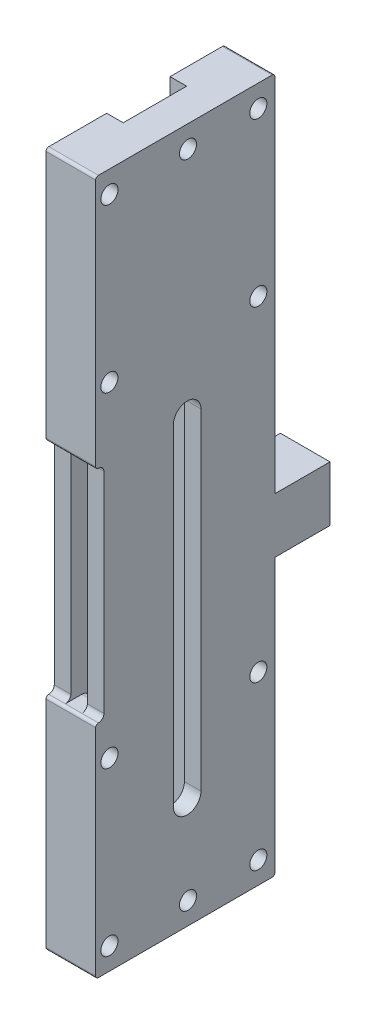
ISO-10303-21;
HEADER;
FILE_DESCRIPTION(('STEP AP214'),'2;1');
FILE_NAME('part.step','',(''),(''),'','','');
FILE_SCHEMA(('AUTOMOTIVE_DESIGN { 1 0 10303 214 1 1 1 1 }'));
ENDSEC;
DATA;
#1=APPLICATION_CONTEXT('core data for automotive mechanical design processes');
#2=APPLICATION_PROTOCOL_DEFINITION('international standard','automotive_design',2000,#1);
#3=PRODUCT_CONTEXT('',#1,'mechanical');
#4=PRODUCT('Part','Part','',(#3));
#5=PRODUCT_RELATED_PRODUCT_CATEGORY('part','',(#4));
#6=PRODUCT_DEFINITION_FORMATION('','',#4);
#7=PRODUCT_DEFINITION_CONTEXT('part definition',#1,'design');
#8=PRODUCT_DEFINITION('design','',#6,#7);
#9=PRODUCT_DEFINITION_SHAPE('','',#8);
#10=(LENGTH_UNIT() NAMED_UNIT(*) SI_UNIT(.MILLI.,.METRE.));
#11=(NAMED_UNIT(*) PLANE_ANGLE_UNIT() SI_UNIT($,.RADIAN.));
#12=(NAMED_UNIT(*) SI_UNIT($,.STERADIAN.) SOLID_ANGLE_UNIT());
#13=UNCERTAINTY_MEASURE_WITH_UNIT(LENGTH_MEASURE(1.E-05),#10,'distance_accuracy_value','');
#14=(GEOMETRIC_REPRESENTATION_CONTEXT(3) GLOBAL_UNCERTAINTY_ASSIGNED_CONTEXT((#13)) GLOBAL_UNIT_ASSIGNED_CONTEXT((#10,
#11,#12)) REPRESENTATION_CONTEXT('',''));
#15=CARTESIAN_POINT('',(0.,0.,0.));
#16=DIRECTION('',(0.,0.,1.));
#17=DIRECTION('',(1.,0.,0.));
#18=AXIS2_PLACEMENT_3D('',#15,#16,#17);
#19=CARTESIAN_POINT('',(0.,0.,22.5));
#20=DIRECTION('',(0.,0.,-1.));
#21=DIRECTION('',(-1.,0.,0.));
#22=AXIS2_PLACEMENT_3D('',#19,#20,#21);
#23=PLANE('',#22);
#24=DIRECTION('',(0.,1.,0.));
#25=VECTOR('',#24,1.);
#26=CARTESIAN_POINT('',(6.,126.,22.5));
#27=LINE('',#26,#25);
#28=CARTESIAN_POINT('',(6.,80.5,22.5));
#29=VERTEX_POINT('',#28);
#30=CARTESIAN_POINT('',(6.,125.5,22.5));
#31=VERTEX_POINT('',#30);
#32=EDGE_CURVE('E548',#29,#31,#27,.T.);
#33=ORIENTED_EDGE('',*,*,#32,.T.);
#34=DIRECTION('',(-1.,0.,0.));
#35=VECTOR('',#34,1.);
#36=CARTESIAN_POINT('',(0.,125.5,22.5));
#37=LINE('',#36,#35);
#38=CARTESIAN_POINT('',(-3.,125.5,22.5));
#39=VERTEX_POINT('',#38);
#40=EDGE_CURVE('E604',#31,#39,#37,.T.);
#41=ORIENTED_EDGE('',*,*,#40,.T.);
#42=DIRECTION('',(0.,-1.,0.));
#43=VECTOR('',#42,1.);
#44=CARTESIAN_POINT('',(-3.,126.,22.5));
#45=LINE('',#44,#43);
#46=CARTESIAN_POINT('',(-3.,80.5,22.5));
#47=VERTEX_POINT('',#46);
#48=EDGE_CURVE('E541',#39,#47,#45,.T.);
#49=ORIENTED_EDGE('',*,*,#48,.T.);
#50=DIRECTION('',(-1.,0.,0.));
#51=VECTOR('',#50,1.);
#52=CARTESIAN_POINT('',(0.,80.5,22.5));
#53=LINE('',#52,#51);
#54=EDGE_CURVE('E602',#47,#29,#53,.F.);
#55=ORIENTED_EDGE('',*,*,#54,.T.);
#56=EDGE_LOOP('',(#33,#41,#49,#55));
#57=FACE_BOUND('',#56,.T.);
#58=ADVANCED_FACE('F32',(#57),#23,.F.);
#59=CARTESIAN_POINT('',(-3.,126.,-10.));
#60=DIRECTION('',(0.,0.,1.));
#61=DIRECTION('',(1.,0.,0.));
#62=AXIS2_PLACEMENT_3D('',#59,#60,#61);
#63=PLANE('',#62);
#64=DIRECTION('',(0.,-1.,0.));
#65=VECTOR('',#64,1.);
#66=CARTESIAN_POINT('',(-3.,126.,-10.));
#67=LINE('',#66,#65);
#68=CARTESIAN_POINT('',(-3.,125.5,-10.));
#69=VERTEX_POINT('',#68);
#70=CARTESIAN_POINT('',(-3.00000000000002,60.,-10.));
#71=VERTEX_POINT('',#70);
#72=EDGE_CURVE('E572',#69,#71,#67,.T.);
#73=ORIENTED_EDGE('',*,*,#72,.F.);
#74=DIRECTION('',(-1.,0.,0.));
#75=VECTOR('',#74,1.);
#76=CARTESIAN_POINT('',(-3.,125.5,-10.));
#77=LINE('',#76,#75);
#78=CARTESIAN_POINT('',(6.,125.5,-10.));
#79=VERTEX_POINT('',#78);
#80=EDGE_CURVE('E588',#69,#79,#77,.F.);
#81=ORIENTED_EDGE('',*,*,#80,.T.);
#82=DIRECTION('',(0.,-1.,0.));
#83=VECTOR('',#82,1.);
#84=CARTESIAN_POINT('',(6.,126.,-10.));
#85=LINE('',#84,#83);
#86=CARTESIAN_POINT('',(6.,60.,-10.));
#87=VERTEX_POINT('',#86);
#88=EDGE_CURVE('E575',#79,#87,#85,.T.);
#89=ORIENTED_EDGE('',*,*,#88,.T.);
#90=DIRECTION('',(1.,0.,0.));
#91=VECTOR('',#90,1.);
#92=CARTESIAN_POINT('',(-3.00000000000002,60.,-10.));
#93=LINE('',#92,#91);
#94=EDGE_CURVE('E371',#71,#87,#93,.T.);
#95=ORIENTED_EDGE('',*,*,#94,.F.);
#96=EDGE_LOOP('',(#73,#81,#89,#95));
#97=FACE_BOUND('',#96,.T.);
#98=ADVANCED_FACE('F721',(#97),#63,.F.);
#99=CARTESIAN_POINT('',(0.,126.,17.5));
#100=DIRECTION('',(0.,0.,-1.));
#101=DIRECTION('',(-1.,0.,0.));
#102=AXIS2_PLACEMENT_3D('',#99,#100,#101);
#103=PLANE('',#102);
#104=DIRECTION('',(0.,-1.,0.));
#105=VECTOR('',#104,1.);
#106=CARTESIAN_POINT('',(0.,126.,17.5));
#107=LINE('',#106,#105);
#108=CARTESIAN_POINT('',(0.,38.5,17.5));
#109=VERTEX_POINT('',#108);
#110=CARTESIAN_POINT('',(0.,8.,17.5));
#111=VERTEX_POINT('',#110);
#112=EDGE_CURVE('E532',#109,#111,#107,.T.);
#113=ORIENTED_EDGE('',*,*,#112,.F.);
#114=DIRECTION('',(1.,0.,0.));
#115=VECTOR('',#114,1.);
#116=CARTESIAN_POINT('',(3.,38.5,17.5));
#117=LINE('',#116,#115);
#118=CARTESIAN_POINT('',(3.00000000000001,38.5,17.5));
#119=VERTEX_POINT('',#118);
#120=EDGE_CURVE('E632',#109,#119,#117,.T.);
#121=ORIENTED_EDGE('',*,*,#120,.T.);
#122=DIRECTION('',(0.,-1.,0.));
#123=VECTOR('',#122,1.);
#124=CARTESIAN_POINT('',(3.00000000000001,126.,17.5));
#125=LINE('',#124,#123);
#126=CARTESIAN_POINT('',(3.00000000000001,8.,17.5));
#127=VERTEX_POINT('',#126);
#128=EDGE_CURVE('E529',#119,#127,#125,.T.);
#129=ORIENTED_EDGE('',*,*,#128,.T.);
#130=DIRECTION('',(1.,0.,0.));
#131=VECTOR('',#130,1.);
#132=CARTESIAN_POINT('',(0.,8.,17.5));
#133=LINE('',#132,#131);
#134=EDGE_CURVE('E464',#111,#127,#133,.T.);
#135=ORIENTED_EDGE('',*,*,#134,.F.);
#136=EDGE_LOOP('',(#113,#121,#129,#135));
#137=FACE_BOUND('',#136,.T.);
#138=ADVANCED_FACE('F656',(#137),#103,.T.);
#139=CARTESIAN_POINT('',(6.,126.,-4.));
#140=DIRECTION('',(0.,0.,-1.));
#141=DIRECTION('',(-1.,0.,0.));
#142=AXIS2_PLACEMENT_3D('',#139,#140,#141);
#143=PLANE('',#142);
#144=DIRECTION('',(0.,-1.,0.));
#145=VECTOR('',#144,1.);
#146=CARTESIAN_POINT('',(2.99999999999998,126.,-4.));
#147=LINE('',#146,#145);
#148=CARTESIAN_POINT('',(2.99999999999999,118.,-4.));
#149=VERTEX_POINT('',#148);
#150=CARTESIAN_POINT('',(3.00000000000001,8.,-4.));
#151=VERTEX_POINT('',#150);
#152=EDGE_CURVE('E528',#149,#151,#147,.T.);
#153=ORIENTED_EDGE('',*,*,#152,.F.);
#154=DIRECTION('',(-1.,0.,0.));
#155=VECTOR('',#154,1.);
#156=CARTESIAN_POINT('',(2.99999999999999,118.,-4.));
#157=LINE('',#156,#155);
#158=CARTESIAN_POINT('',(0.,118.,-4.));
#159=VERTEX_POINT('',#158);
#160=EDGE_CURVE('E444',#149,#159,#157,.T.);
#161=ORIENTED_EDGE('',*,*,#160,.T.);
#162=DIRECTION('',(0.,-1.,0.));
#163=VECTOR('',#162,1.);
#164=CARTESIAN_POINT('',(0.,126.,-4.));
#165=LINE('',#164,#163);
#166=CARTESIAN_POINT('',(0.,8.,-4.));
#167=VERTEX_POINT('',#166);
#168=EDGE_CURVE('E577',#159,#167,#165,.T.);
#169=ORIENTED_EDGE('',*,*,#168,.T.);
#170=DIRECTION('',(1.,0.,0.));
#171=VECTOR('',#170,1.);
#172=CARTESIAN_POINT('',(0.,8.,-4.));
#173=LINE('',#172,#171);
#174=EDGE_CURVE('E458',#167,#151,#173,.T.);
#175=ORIENTED_EDGE('',*,*,#174,.T.);
#176=EDGE_LOOP('',(#153,#161,#169,#175));
#177=FACE_BOUND('',#176,.T.);
#178=ADVANCED_FACE('F798',(#177),#143,.F.);
#179=CARTESIAN_POINT('',(0.,126.,-4.));
#180=DIRECTION('',(-1.,0.,0.));
#181=DIRECTION('',(0.,0.,1.));
#182=AXIS2_PLACEMENT_3D('',#179,#180,#181);
#183=PLANE('',#182);
#184=ORIENTED_EDGE('',*,*,#168,.F.);
#185=DIRECTION('',(0.,0.,1.));
#186=VECTOR('',#185,1.);
#187=CARTESIAN_POINT('',(0.,118.,-4.));
#188=LINE('',#187,#186);
#189=CARTESIAN_POINT('',(0.,118.,0.));
#190=VERTEX_POINT('',#189);
#191=EDGE_CURVE('E448',#159,#190,#188,.T.);
#192=ORIENTED_EDGE('',*,*,#191,.T.);
#193=DIRECTION('',(0.,-1.,0.));
#194=VECTOR('',#193,1.);
#195=CARTESIAN_POINT('',(0.,126.,0.));
#196=LINE('',#195,#194);
#197=CARTESIAN_POINT('',(0.,8.,0.));
#198=VERTEX_POINT('',#197);
#199=EDGE_CURVE('E559',#190,#198,#196,.T.);
#200=ORIENTED_EDGE('',*,*,#199,.T.);
#201=DIRECTION('',(0.,0.,1.));
#202=VECTOR('',#201,1.);
#203=CARTESIAN_POINT('',(0.,8.,-4.));
#204=LINE('',#203,#202);
#205=EDGE_CURVE('E468',#167,#198,#204,.T.);
#206=ORIENTED_EDGE('',*,*,#205,.F.);
#207=EDGE_LOOP('',(#184,#192,#200,#206));
#208=FACE_BOUND('',#207,.T.);
#209=ADVANCED_FACE('F783',(#208),#183,.F.);
#210=CARTESIAN_POINT('',(2.99999999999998,126.,22.5));
#211=DIRECTION('',(1.,0.,0.));
#212=DIRECTION('',(0.,1.,0.));
#213=AXIS2_PLACEMENT_3D('',#210,#211,#212);
#214=PLANE('',#213);
#215=DIRECTION('',(0.,-1.,0.));
#216=VECTOR('',#215,1.);
#217=CARTESIAN_POINT('',(2.99999999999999,80.,3.4));
#218=LINE('',#217,#216);
#219=CARTESIAN_POINT('',(3.,80.,3.4));
#220=VERTEX_POINT('',#219);
#221=CARTESIAN_POINT('',(3.,20.,3.4));
#222=VERTEX_POINT('',#221);
#223=EDGE_CURVE('E477',#220,#222,#218,.T.);
#224=ORIENTED_EDGE('',*,*,#223,.F.);
#225=CARTESIAN_POINT('',(2.99999999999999,80.,5.9));
#226=DIRECTION('',(1.,0.,0.));
#227=DIRECTION('',(0.,1.,0.));
#228=AXIS2_PLACEMENT_3D('',#225,#226,#227);
#229=CIRCLE('',#228,2.5);
#230=CARTESIAN_POINT('',(2.99999999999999,80.,8.4));
#231=VERTEX_POINT('',#230);
#232=EDGE_CURVE('E480',#231,#220,#229,.F.);
#233=ORIENTED_EDGE('',*,*,#232,.F.);
#234=DIRECTION('',(0.,1.,0.));
#235=VECTOR('',#234,1.);
#236=CARTESIAN_POINT('',(2.99999999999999,80.,8.4));
#237=LINE('',#236,#235);
#238=CARTESIAN_POINT('',(3.,20.,8.4));
#239=VERTEX_POINT('',#238);
#240=EDGE_CURVE('E497',#239,#231,#237,.T.);
#241=ORIENTED_EDGE('',*,*,#240,.F.);
#242=CARTESIAN_POINT('',(3.,20.,5.9));
#243=DIRECTION('',(1.,0.,0.));
#244=DIRECTION('',(0.,1.,0.));
#245=AXIS2_PLACEMENT_3D('',#242,#243,#244);
#246=CIRCLE('',#245,2.5);
#247=EDGE_CURVE('E475',#222,#239,#246,.F.);
#248=ORIENTED_EDGE('',*,*,#247,.F.);
#249=EDGE_LOOP('',(#224,#233,#241,#248));
#250=FACE_BOUND('',#249,.T.);
#251=DIRECTION('',(0.,1.,0.));
#252=VECTOR('',#251,1.);
#253=CARTESIAN_POINT('',(2.99999999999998,126.,21.));
#254=LINE('',#253,#252);
#255=CARTESIAN_POINT('',(3.,41.,21.));
#256=VERTEX_POINT('',#255);
#257=CARTESIAN_POINT('',(3.,79.,21.));
#258=VERTEX_POINT('',#257);
#259=EDGE_CURVE('E349',#256,#258,#254,.T.);
#260=ORIENTED_EDGE('',*,*,#259,.T.);
#261=CARTESIAN_POINT('',(2.99999999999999,79.,22.));
#262=DIRECTION('',(1.,0.,0.));
#263=DIRECTION('',(0.,1.,0.));
#264=AXIS2_PLACEMENT_3D('',#261,#262,#263);
#265=CIRCLE('',#264,1.);
#266=CARTESIAN_POINT('',(3.,80.,22.));
#267=VERTEX_POINT('',#266);
#268=EDGE_CURVE('E340',#258,#267,#265,.T.);
#269=ORIENTED_EDGE('',*,*,#268,.T.);
#270=DIRECTION('',(0.,0.,1.));
#271=VECTOR('',#270,1.);
#272=CARTESIAN_POINT('',(3.,80.,-10.001));
#273=LINE('',#272,#271);
#274=CARTESIAN_POINT('',(3.,80.,19.));
#275=VERTEX_POINT('',#274);
#276=EDGE_CURVE('E510',#275,#267,#273,.T.);
#277=ORIENTED_EDGE('',*,*,#276,.F.);
#278=CARTESIAN_POINT('',(2.99999999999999,81.5,19.));
#279=DIRECTION('',(1.,0.,0.));
#280=DIRECTION('',(0.,1.,0.));
#281=AXIS2_PLACEMENT_3D('',#278,#279,#280);
#282=CIRCLE('',#281,1.5);
#283=CARTESIAN_POINT('',(3.00000000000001,81.5,17.5));
#284=VERTEX_POINT('',#283);
#285=EDGE_CURVE('E11',#275,#284,#282,.T.);
#286=ORIENTED_EDGE('',*,*,#285,.T.);
#287=CARTESIAN_POINT('',(3.00000000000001,118.,17.5));
#288=VERTEX_POINT('',#287);
#289=EDGE_CURVE('E525',#288,#284,#125,.T.);
#290=ORIENTED_EDGE('',*,*,#289,.F.);
#291=DIRECTION('',(0.,0.,-1.));
#292=VECTOR('',#291,1.);
#293=CARTESIAN_POINT('',(2.99999999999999,118.,-4.));
#294=LINE('',#293,#292);
#295=EDGE_CURVE('E441',#288,#149,#294,.T.);
#296=ORIENTED_EDGE('',*,*,#295,.T.);
#297=ORIENTED_EDGE('',*,*,#152,.T.);
#298=DIRECTION('',(0.,0.,1.));
#299=VECTOR('',#298,1.);
#300=CARTESIAN_POINT('',(3.00000000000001,8.,-4.));
#301=LINE('',#300,#299);
#302=EDGE_CURVE('E461',#151,#127,#301,.T.);
#303=ORIENTED_EDGE('',*,*,#302,.T.);
#304=ORIENTED_EDGE('',*,*,#128,.F.);
#305=CARTESIAN_POINT('',(3.,38.5,19.));
#306=DIRECTION('',(1.,0.,0.));
#307=DIRECTION('',(0.,1.,0.));
#308=AXIS2_PLACEMENT_3D('',#305,#306,#307);
#309=CIRCLE('',#308,1.5);
#310=CARTESIAN_POINT('',(3.,40.,19.));
#311=VERTEX_POINT('',#310);
#312=EDGE_CURVE('E641',#119,#311,#309,.T.);
#313=ORIENTED_EDGE('',*,*,#312,.T.);
#314=DIRECTION('',(0.,0.,1.));
#315=VECTOR('',#314,1.);
#316=CARTESIAN_POINT('',(3.,40.,-10.001));
#317=LINE('',#316,#315);
#318=CARTESIAN_POINT('',(3.,40.,22.));
#319=VERTEX_POINT('',#318);
#320=EDGE_CURVE('E506',#311,#319,#317,.T.);
#321=ORIENTED_EDGE('',*,*,#320,.T.);
#322=CARTESIAN_POINT('',(3.,41.,22.));
#323=DIRECTION('',(1.,0.,0.));
#324=DIRECTION('',(0.,1.,0.));
#325=AXIS2_PLACEMENT_3D('',#322,#323,#324);
#326=CIRCLE('',#325,1.);
#327=EDGE_CURVE('E344',#319,#256,#326,.T.);
#328=ORIENTED_EDGE('',*,*,#327,.T.);
#329=EDGE_LOOP('',(#260,#269,#277,#286,#290,#296,#297,#303,#304,#313,#321,#328));
#330=FACE_BOUND('',#329,.T.);
#331=ADVANCED_FACE('F661',(#250,#330),#214,.F.);
#332=CARTESIAN_POINT('',(0.,126.,11.5));
#333=DIRECTION('',(1.,0.,0.));
#334=DIRECTION('',(0.,0.,-1.));
#335=AXIS2_PLACEMENT_3D('',#332,#333,#334);
#336=PLANE('',#335);
#337=CARTESIAN_POINT('',(0.,79.,22.));
#338=DIRECTION('',(1.,0.,0.));
#339=DIRECTION('',(0.,0.,-1.));
#340=AXIS2_PLACEMENT_3D('',#337,#338,#339);
#341=CIRCLE('',#340,1.);
#342=CARTESIAN_POINT('',(0.,79.,21.));
#343=VERTEX_POINT('',#342);
#344=CARTESIAN_POINT('',(0.,80.,22.));
#345=VERTEX_POINT('',#344);
#346=EDGE_CURVE('E333',#343,#345,#341,.T.);
#347=ORIENTED_EDGE('',*,*,#346,.F.);
#348=DIRECTION('',(0.,1.,0.));
#349=VECTOR('',#348,1.);
#350=CARTESIAN_POINT('',(0.,126.,21.));
#351=LINE('',#350,#349);
#352=CARTESIAN_POINT('',(0.,41.,21.));
#353=VERTEX_POINT('',#352);
#354=EDGE_CURVE('E347',#353,#343,#351,.T.);
#355=ORIENTED_EDGE('',*,*,#354,.F.);
#356=CARTESIAN_POINT('',(0.,41.,22.));
#357=DIRECTION('',(1.,0.,0.));
#358=DIRECTION('',(0.,0.,-1.));
#359=AXIS2_PLACEMENT_3D('',#356,#357,#358);
#360=CIRCLE('',#359,1.);
#361=CARTESIAN_POINT('',(0.,40.,22.));
#362=VERTEX_POINT('',#361);
#363=EDGE_CURVE('E295',#362,#353,#360,.T.);
#364=ORIENTED_EDGE('',*,*,#363,.F.);
#365=DIRECTION('',(0.,0.,1.));
#366=VECTOR('',#365,1.);
#367=CARTESIAN_POINT('',(0.,40.,-10.001));
#368=LINE('',#367,#366);
#369=CARTESIAN_POINT('',(0.,40.,19.));
#370=VERTEX_POINT('',#369);
#371=EDGE_CURVE('E509',#370,#362,#368,.T.);
#372=ORIENTED_EDGE('',*,*,#371,.F.);
#373=CARTESIAN_POINT('',(0.,38.5,19.));
#374=DIRECTION('',(1.,0.,0.));
#375=DIRECTION('',(0.,0.,-1.));
#376=AXIS2_PLACEMENT_3D('',#373,#374,#375);
#377=CIRCLE('',#376,1.5);
#378=EDGE_CURVE('E643',#370,#109,#377,.F.);
#379=ORIENTED_EDGE('',*,*,#378,.T.);
#380=ORIENTED_EDGE('',*,*,#112,.T.);
#381=CARTESIAN_POINT('',(0.,8.,11.5));
#382=VERTEX_POINT('',#381);
#383=EDGE_CURVE('E467',#382,#111,#204,.T.);
#384=ORIENTED_EDGE('',*,*,#383,.F.);
#385=DIRECTION('',(0.,-1.,0.));
#386=VECTOR('',#385,1.);
#387=CARTESIAN_POINT('',(0.,126.,11.5));
#388=LINE('',#387,#386);
#389=CARTESIAN_POINT('',(0.,118.,11.5));
#390=VERTEX_POINT('',#389);
#391=EDGE_CURVE('E536',#390,#382,#388,.T.);
#392=ORIENTED_EDGE('',*,*,#391,.F.);
#393=CARTESIAN_POINT('',(0.,118.,17.5));
#394=VERTEX_POINT('',#393);
#395=EDGE_CURVE('E447',#390,#394,#188,.T.);
#396=ORIENTED_EDGE('',*,*,#395,.T.);
#397=CARTESIAN_POINT('',(0.,81.5,17.5));
#398=VERTEX_POINT('',#397);
#399=EDGE_CURVE('E530',#394,#398,#107,.T.);
#400=ORIENTED_EDGE('',*,*,#399,.T.);
#401=CARTESIAN_POINT('',(0.,81.5,19.));
#402=DIRECTION('',(1.,0.,0.));
#403=DIRECTION('',(0.,0.,-1.));
#404=AXIS2_PLACEMENT_3D('',#401,#402,#403);
#405=CIRCLE('',#404,1.5);
#406=CARTESIAN_POINT('',(0.,80.,19.));
#407=VERTEX_POINT('',#406);
#408=EDGE_CURVE('E40',#398,#407,#405,.F.);
#409=ORIENTED_EDGE('',*,*,#408,.T.);
#410=DIRECTION('',(0.,0.,1.));
#411=VECTOR('',#410,1.);
#412=CARTESIAN_POINT('',(0.,80.,-10.001));
#413=LINE('',#412,#411);
#414=EDGE_CURVE('E507',#407,#345,#413,.T.);
#415=ORIENTED_EDGE('',*,*,#414,.T.);
#416=EDGE_LOOP('',(#347,#355,#364,#372,#379,#380,#384,#392,#396,#400,#409,#415));
#417=FACE_BOUND('',#416,.T.);
#418=ADVANCED_FACE('F648',(#417),#336,.T.);
#419=CARTESIAN_POINT('',(6.,126.,-10.));
#420=DIRECTION('',(-1.,0.,0.));
#421=DIRECTION('',(0.,0.,1.));
#422=AXIS2_PLACEMENT_3D('',#419,#420,#421);
#423=PLANE('',#422);
#424=CARTESIAN_POINT('',(6.,122.,20.));
#425=DIRECTION('',(-1.,0.,0.));
#426=DIRECTION('',(0.,0.,1.));
#427=AXIS2_PLACEMENT_3D('',#424,#425,#426);
#428=CIRCLE('',#427,1.55);
#429=CARTESIAN_POINT('',(6.,122.,21.55));
#430=VERTEX_POINT('',#429);
#431=EDGE_CURVE('E404',#430,#430,#428,.F.);
#432=ORIENTED_EDGE('',*,*,#431,.F.);
#433=EDGE_LOOP('',(#432));
#434=FACE_BOUND('',#433,.T.);
#435=CARTESIAN_POINT('',(6.,33.5,20.));
#436=DIRECTION('',(-1.,0.,0.));
#437=DIRECTION('',(0.,0.,1.));
#438=AXIS2_PLACEMENT_3D('',#435,#436,#437);
#439=CIRCLE('',#438,1.55);
#440=CARTESIAN_POINT('',(6.,33.5,21.55));
#441=VERTEX_POINT('',#440);
#442=EDGE_CURVE('E398',#441,#441,#439,.F.);
#443=ORIENTED_EDGE('',*,*,#442,.F.);
#444=EDGE_LOOP('',(#443));
#445=FACE_BOUND('',#444,.T.);
#446=CARTESIAN_POINT('',(6.,33.5,-6.99999999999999));
#447=DIRECTION('',(-1.,0.,0.));
#448=DIRECTION('',(0.,0.,1.));
#449=AXIS2_PLACEMENT_3D('',#446,#447,#448);
#450=CIRCLE('',#449,1.55);
#451=CARTESIAN_POINT('',(6.,33.5,-5.44999999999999));
#452=VERTEX_POINT('',#451);
#453=EDGE_CURVE('E391',#452,#452,#450,.F.);
#454=ORIENTED_EDGE('',*,*,#453,.F.);
#455=EDGE_LOOP('',(#454));
#456=FACE_BOUND('',#455,.T.);
#457=CARTESIAN_POINT('',(6.,92.5,-6.99999999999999));
#458=DIRECTION('',(-1.,0.,0.));
#459=DIRECTION('',(0.,0.,1.));
#460=AXIS2_PLACEMENT_3D('',#457,#458,#459);
#461=CIRCLE('',#460,1.55);
#462=CARTESIAN_POINT('',(6.,92.5,-5.44999999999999));
#463=VERTEX_POINT('',#462);
#464=EDGE_CURVE('E390',#463,#463,#461,.F.);
#465=ORIENTED_EDGE('',*,*,#464,.F.);
#466=EDGE_LOOP('',(#465));
#467=FACE_BOUND('',#466,.T.);
#468=CARTESIAN_POINT('',(6.,122.,-6.99999999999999));
#469=DIRECTION('',(-1.,0.,0.));
#470=DIRECTION('',(0.,0.,1.));
#471=AXIS2_PLACEMENT_3D('',#468,#469,#470);
#472=CIRCLE('',#471,1.55);
#473=CARTESIAN_POINT('',(6.,122.,-5.45));
#474=VERTEX_POINT('',#473);
#475=EDGE_CURVE('E426',#474,#474,#472,.F.);
#476=ORIENTED_EDGE('',*,*,#475,.F.);
#477=EDGE_LOOP('',(#476));
#478=FACE_BOUND('',#477,.T.);
#479=CARTESIAN_POINT('',(6.,4.,20.));
#480=DIRECTION('',(-1.,0.,0.));
#481=DIRECTION('',(0.,0.,1.));
#482=AXIS2_PLACEMENT_3D('',#479,#480,#481);
#483=CIRCLE('',#482,1.55);
#484=CARTESIAN_POINT('',(6.,4.,21.55));
#485=VERTEX_POINT('',#484);
#486=EDGE_CURVE('E427',#485,#485,#483,.F.);
#487=ORIENTED_EDGE('',*,*,#486,.F.);
#488=EDGE_LOOP('',(#487));
#489=FACE_BOUND('',#488,.T.);
#490=CARTESIAN_POINT('',(6.,4.,-6.99999999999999));
#491=DIRECTION('',(-1.,0.,0.));
#492=DIRECTION('',(0.,0.,1.));
#493=AXIS2_PLACEMENT_3D('',#490,#491,#492);
#494=CIRCLE('',#493,1.55);
#495=CARTESIAN_POINT('',(6.,4.,-5.45));
#496=VERTEX_POINT('',#495);
#497=EDGE_CURVE('E414',#496,#496,#494,.F.);
#498=ORIENTED_EDGE('',*,*,#497,.F.);
#499=EDGE_LOOP('',(#498));
#500=FACE_BOUND('',#499,.T.);
#501=CARTESIAN_POINT('',(6.,4.,5.75000000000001));
#502=DIRECTION('',(-1.,0.,0.));
#503=DIRECTION('',(0.,0.,1.));
#504=AXIS2_PLACEMENT_3D('',#501,#502,#503);
#505=CIRCLE('',#504,1.55);
#506=CARTESIAN_POINT('',(6.,4.,7.30000000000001));
#507=VERTEX_POINT('',#506);
#508=EDGE_CURVE('E415',#507,#507,#505,.F.);
#509=ORIENTED_EDGE('',*,*,#508,.F.);
#510=EDGE_LOOP('',(#509));
#511=FACE_BOUND('',#510,.T.);
#512=CARTESIAN_POINT('',(6.,92.5,20.));
#513=DIRECTION('',(-1.,0.,0.));
#514=DIRECTION('',(0.,0.,1.));
#515=AXIS2_PLACEMENT_3D('',#512,#513,#514);
#516=CIRCLE('',#515,1.55);
#517=CARTESIAN_POINT('',(6.,92.5,21.55));
#518=VERTEX_POINT('',#517);
#519=EDGE_CURVE('E383',#518,#518,#516,.F.);
#520=ORIENTED_EDGE('',*,*,#519,.F.);
#521=EDGE_LOOP('',(#520));
#522=FACE_BOUND('',#521,.T.);
#523=CARTESIAN_POINT('',(6.,122.,5.75000000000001));
#524=DIRECTION('',(-1.,0.,0.));
#525=DIRECTION('',(0.,0.,1.));
#526=AXIS2_PLACEMENT_3D('',#523,#524,#525);
#527=CIRCLE('',#526,1.54999999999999);
#528=CARTESIAN_POINT('',(6.,122.,7.3));
#529=VERTEX_POINT('',#528);
#530=EDGE_CURVE('E437',#529,#529,#527,.F.);
#531=ORIENTED_EDGE('',*,*,#530,.F.);
#532=EDGE_LOOP('',(#531));
#533=FACE_BOUND('',#532,.T.);
#534=DIRECTION('',(0.,-1.,0.));
#535=VECTOR('',#534,1.);
#536=CARTESIAN_POINT('',(6.,80.,8.4));
#537=LINE('',#536,#535);
#538=CARTESIAN_POINT('',(6.,80.,8.4));
#539=VERTEX_POINT('',#538);
#540=CARTESIAN_POINT('',(6.,20.,8.4));
#541=VERTEX_POINT('',#540);
#542=EDGE_CURVE('E485',#539,#541,#537,.T.);
#543=ORIENTED_EDGE('',*,*,#542,.F.);
#544=CARTESIAN_POINT('',(6.,80.,5.9));
#545=DIRECTION('',(1.,0.,0.));
#546=DIRECTION('',(0.,0.,-1.));
#547=AXIS2_PLACEMENT_3D('',#544,#545,#546);
#548=CIRCLE('',#547,2.5);
#549=CARTESIAN_POINT('',(6.,80.,3.4));
#550=VERTEX_POINT('',#549);
#551=EDGE_CURVE('E483',#550,#539,#548,.T.);
#552=ORIENTED_EDGE('',*,*,#551,.F.);
#553=DIRECTION('',(0.,1.,0.));
#554=VECTOR('',#553,1.);
#555=CARTESIAN_POINT('',(6.,80.,3.4));
#556=LINE('',#555,#554);
#557=CARTESIAN_POINT('',(6.,20.,3.4));
#558=VERTEX_POINT('',#557);
#559=EDGE_CURVE('E491',#558,#550,#556,.T.);
#560=ORIENTED_EDGE('',*,*,#559,.F.);
#561=CARTESIAN_POINT('',(6.,20.,5.9));
#562=DIRECTION('',(1.,0.,0.));
#563=DIRECTION('',(0.,0.,-1.));
#564=AXIS2_PLACEMENT_3D('',#561,#562,#563);
#565=CIRCLE('',#564,2.5);
#566=EDGE_CURVE('E488',#541,#558,#565,.T.);
#567=ORIENTED_EDGE('',*,*,#566,.F.);
#568=EDGE_LOOP('',(#543,#552,#560,#567));
#569=FACE_BOUND('',#568,.T.);
#570=ORIENTED_EDGE('',*,*,#88,.F.);
#571=CARTESIAN_POINT('',(6.,125.5,-9.5));
#572=DIRECTION('',(-1.,0.,0.));
#573=DIRECTION('',(0.,0.,1.));
#574=AXIS2_PLACEMENT_3D('',#571,#572,#573);
#575=CIRCLE('',#574,0.5);
#576=CARTESIAN_POINT('',(6.,126.,-9.5));
#577=VERTEX_POINT('',#576);
#578=EDGE_CURVE('E600',#79,#577,#575,.F.);
#579=ORIENTED_EDGE('',*,*,#578,.T.);
#580=DIRECTION('',(0.,0.,-1.));
#581=VECTOR('',#580,1.);
#582=CARTESIAN_POINT('',(6.,126.,-10.));
#583=LINE('',#582,#581);
#584=CARTESIAN_POINT('',(6.,126.,22.));
#585=VERTEX_POINT('',#584);
#586=EDGE_CURVE('E550',#585,#577,#583,.T.);
#587=ORIENTED_EDGE('',*,*,#586,.F.);
#588=CARTESIAN_POINT('',(6.,125.5,22.));
#589=DIRECTION('',(-1.,0.,0.));
#590=DIRECTION('',(0.,0.,1.));
#591=AXIS2_PLACEMENT_3D('',#588,#589,#590);
#592=CIRCLE('',#591,0.5);
#593=EDGE_CURVE('E598',#585,#31,#592,.F.);
#594=ORIENTED_EDGE('',*,*,#593,.T.);
#595=ORIENTED_EDGE('',*,*,#32,.F.);
#596=CARTESIAN_POINT('',(6.,80.5,22.));
#597=DIRECTION('',(-1.,0.,0.));
#598=DIRECTION('',(0.,0.,1.));
#599=AXIS2_PLACEMENT_3D('',#596,#597,#598);
#600=CIRCLE('',#599,0.5);
#601=CARTESIAN_POINT('',(6.,80.,22.));
#602=VERTEX_POINT('',#601);
#603=EDGE_CURVE('E592',#29,#602,#600,.F.);
#604=ORIENTED_EDGE('',*,*,#603,.T.);
#605=CARTESIAN_POINT('',(6.,79.,22.));
#606=DIRECTION('',(1.,0.,0.));
#607=DIRECTION('',(0.,0.,1.));
#608=AXIS2_PLACEMENT_3D('',#605,#606,#607);
#609=CIRCLE('',#608,1.);
#610=CARTESIAN_POINT('',(6.,79.,21.));
#611=VERTEX_POINT('',#610);
#612=EDGE_CURVE('E317',#611,#602,#609,.T.);
#613=ORIENTED_EDGE('',*,*,#612,.F.);
#614=DIRECTION('',(0.,1.,0.));
#615=VECTOR('',#614,1.);
#616=CARTESIAN_POINT('',(6.,79.,21.));
#617=LINE('',#616,#615);
#618=CARTESIAN_POINT('',(6.,41.,21.));
#619=VERTEX_POINT('',#618);
#620=EDGE_CURVE('E320',#619,#611,#617,.T.);
#621=ORIENTED_EDGE('',*,*,#620,.F.);
#622=CARTESIAN_POINT('',(6.,41.,22.));
#623=DIRECTION('',(1.,0.,0.));
#624=DIRECTION('',(0.,0.,-1.));
#625=AXIS2_PLACEMENT_3D('',#622,#623,#624);
#626=CIRCLE('',#625,1.);
#627=CARTESIAN_POINT('',(6.,40.,22.));
#628=VERTEX_POINT('',#627);
#629=EDGE_CURVE('E325',#628,#619,#626,.T.);
#630=ORIENTED_EDGE('',*,*,#629,.F.);
#631=CARTESIAN_POINT('',(6.,39.5,22.));
#632=DIRECTION('',(-1.,0.,0.));
#633=DIRECTION('',(0.,0.,1.));
#634=AXIS2_PLACEMENT_3D('',#631,#632,#633);
#635=CIRCLE('',#634,0.5);
#636=CARTESIAN_POINT('',(6.,39.5,22.5));
#637=VERTEX_POINT('',#636);
#638=EDGE_CURVE('E590',#628,#637,#635,.F.);
#639=ORIENTED_EDGE('',*,*,#638,.T.);
#640=CARTESIAN_POINT('',(6.,0.5,22.5));
#641=VERTEX_POINT('',#640);
#642=EDGE_CURVE('E544',#641,#637,#27,.T.);
#643=ORIENTED_EDGE('',*,*,#642,.F.);
#644=CARTESIAN_POINT('',(6.,0.5,22.));
#645=DIRECTION('',(-1.,0.,0.));
#646=DIRECTION('',(0.,0.,1.));
#647=AXIS2_PLACEMENT_3D('',#644,#645,#646);
#648=CIRCLE('',#647,0.5);
#649=CARTESIAN_POINT('',(6.,0.,22.));
#650=VERTEX_POINT('',#649);
#651=EDGE_CURVE('E594',#641,#650,#648,.F.);
#652=ORIENTED_EDGE('',*,*,#651,.T.);
#653=DIRECTION('',(0.,0.,-1.));
#654=VECTOR('',#653,1.);
#655=CARTESIAN_POINT('',(6.,0.,-10.));
#656=LINE('',#655,#654);
#657=CARTESIAN_POINT('',(6.,0.,-9.5));
#658=VERTEX_POINT('',#657);
#659=EDGE_CURVE('E547',#650,#658,#656,.T.);
#660=ORIENTED_EDGE('',*,*,#659,.T.);
#661=CARTESIAN_POINT('',(6.,0.5,-9.5));
#662=DIRECTION('',(-1.,0.,0.));
#663=DIRECTION('',(0.,0.,1.));
#664=AXIS2_PLACEMENT_3D('',#661,#662,#663);
#665=CIRCLE('',#664,0.5);
#666=CARTESIAN_POINT('',(6.,0.5,-10.));
#667=VERTEX_POINT('',#666);
#668=EDGE_CURVE('E596',#658,#667,#665,.F.);
#669=ORIENTED_EDGE('',*,*,#668,.T.);
#670=CARTESIAN_POINT('',(6.,50.,-10.));
#671=VERTEX_POINT('',#670);
#672=EDGE_CURVE('E574',#671,#667,#85,.T.);
#673=ORIENTED_EDGE('',*,*,#672,.F.);
#674=DIRECTION('',(0.,0.,-1.));
#675=VECTOR('',#674,1.);
#676=CARTESIAN_POINT('',(6.,50.,-10.));
#677=LINE('',#676,#675);
#678=CARTESIAN_POINT('',(6.,50.,-20.));
#679=VERTEX_POINT('',#678);
#680=EDGE_CURVE('E352',#671,#679,#677,.T.);
#681=ORIENTED_EDGE('',*,*,#680,.T.);
#682=DIRECTION('',(0.,1.,0.));
#683=VECTOR('',#682,1.);
#684=CARTESIAN_POINT('',(6.,60.,-20.));
#685=LINE('',#684,#683);
#686=CARTESIAN_POINT('',(6.,60.,-20.));
#687=VERTEX_POINT('',#686);
#688=EDGE_CURVE('E366',#679,#687,#685,.T.);
#689=ORIENTED_EDGE('',*,*,#688,.T.);
#690=DIRECTION('',(0.,0.,1.));
#691=VECTOR('',#690,1.);
#692=CARTESIAN_POINT('',(6.,60.,-10.));
#693=LINE('',#692,#691);
#694=EDGE_CURVE('E357',#687,#87,#693,.T.);
#695=ORIENTED_EDGE('',*,*,#694,.T.);
#696=EDGE_LOOP('',(#570,#579,#587,#594,#595,#604,#613,#621,#630,#639,#643,#652,#660,#669,#673,
#681,#689,#695));
#697=FACE_BOUND('',#696,.T.);
#698=ADVANCED_FACE('F678',(#434,#445,#456,#467,#478,#489,#500,#511,#522,#533,#569,#697),#423,.F.);
#699=ORIENTED_EDGE('',*,*,#672,.T.);
#700=DIRECTION('',(-1.,0.,0.));
#701=VECTOR('',#700,1.);
#702=CARTESIAN_POINT('',(-3.,0.5,-10.));
#703=LINE('',#702,#701);
#704=CARTESIAN_POINT('',(-3.,0.5,-10.));
#705=VERTEX_POINT('',#704);
#706=EDGE_CURVE('E614',#667,#705,#703,.T.);
#707=ORIENTED_EDGE('',*,*,#706,.T.);
#708=CARTESIAN_POINT('',(-3.00000000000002,50.,-10.));
#709=VERTEX_POINT('',#708);
#710=EDGE_CURVE('E571',#709,#705,#67,.T.);
#711=ORIENTED_EDGE('',*,*,#710,.F.);
#712=DIRECTION('',(1.,0.,0.));
#713=VECTOR('',#712,1.);
#714=CARTESIAN_POINT('',(-3.00000000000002,50.,-10.));
#715=LINE('',#714,#713);
#716=EDGE_CURVE('E363',#709,#671,#715,.T.);
#717=ORIENTED_EDGE('',*,*,#716,.T.);
#718=EDGE_LOOP('',(#699,#707,#711,#717));
#719=FACE_BOUND('',#718,.T.);
#720=ADVANCED_FACE('F701',(#719),#63,.F.);
#721=CARTESIAN_POINT('',(-3.,126.,0.));
#722=DIRECTION('',(1.,0.,0.));
#723=DIRECTION('',(0.,0.,-1.));
#724=AXIS2_PLACEMENT_3D('',#721,#722,#723);
#725=PLANE('',#724);
#726=CARTESIAN_POINT('',(-2.99999999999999,33.5,-7.));
#727=DIRECTION('',(-1.,0.,0.));
#728=DIRECTION('',(0.,0.,-1.));
#729=AXIS2_PLACEMENT_3D('',#726,#727,#728);
#730=CIRCLE('',#729,1.55);
#731=CARTESIAN_POINT('',(-2.99999999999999,33.5,-8.55));
#732=VERTEX_POINT('',#731);
#733=EDGE_CURVE('E395',#732,#732,#730,.T.);
#734=ORIENTED_EDGE('',*,*,#733,.F.);
#735=EDGE_LOOP('',(#734));
#736=FACE_BOUND('',#735,.T.);
#737=CARTESIAN_POINT('',(-2.99999999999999,92.5,-7.));
#738=DIRECTION('',(-1.,0.,0.));
#739=DIRECTION('',(0.,0.,1.));
#740=AXIS2_PLACEMENT_3D('',#737,#738,#739);
#741=CIRCLE('',#740,1.55);
#742=CARTESIAN_POINT('',(-2.99999999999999,92.5,-5.45));
#743=VERTEX_POINT('',#742);
#744=EDGE_CURVE('E387',#743,#743,#741,.T.);
#745=ORIENTED_EDGE('',*,*,#744,.F.);
#746=EDGE_LOOP('',(#745));
#747=FACE_BOUND('',#746,.T.);
#748=CARTESIAN_POINT('',(-2.99999999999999,122.,-7.));
#749=DIRECTION('',(-1.,0.,0.));
#750=DIRECTION('',(0.,0.,1.));
#751=AXIS2_PLACEMENT_3D('',#748,#749,#750);
#752=CIRCLE('',#751,1.55);
#753=CARTESIAN_POINT('',(-2.99999999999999,122.,-5.45));
#754=VERTEX_POINT('',#753);
#755=EDGE_CURVE('E423',#754,#754,#752,.T.);
#756=ORIENTED_EDGE('',*,*,#755,.F.);
#757=EDGE_LOOP('',(#756));
#758=FACE_BOUND('',#757,.T.);
#759=CARTESIAN_POINT('',(-2.99999999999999,4.,-7.));
#760=DIRECTION('',(-1.,0.,0.));
#761=DIRECTION('',(0.,0.,-1.));
#762=AXIS2_PLACEMENT_3D('',#759,#760,#761);
#763=CIRCLE('',#762,1.55);
#764=CARTESIAN_POINT('',(-2.99999999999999,4.,-8.55));
#765=VERTEX_POINT('',#764);
#766=EDGE_CURVE('E411',#765,#765,#763,.T.);
#767=ORIENTED_EDGE('',*,*,#766,.F.);
#768=EDGE_LOOP('',(#767));
#769=FACE_BOUND('',#768,.T.);
#770=DIRECTION('',(0.,0.,1.));
#771=VECTOR('',#770,1.);
#772=CARTESIAN_POINT('',(-3.,126.,0.));
#773=LINE('',#772,#771);
#774=CARTESIAN_POINT('',(-3.,126.,-9.5));
#775=VERTEX_POINT('',#774);
#776=CARTESIAN_POINT('',(-3.,126.,0.));
#777=VERTEX_POINT('',#776);
#778=EDGE_CURVE('E553',#775,#777,#773,.T.);
#779=ORIENTED_EDGE('',*,*,#778,.F.);
#780=CARTESIAN_POINT('',(-3.,125.5,-9.5));
#781=DIRECTION('',(1.,0.,0.));
#782=DIRECTION('',(0.,0.,-1.));
#783=AXIS2_PLACEMENT_3D('',#780,#781,#782);
#784=CIRCLE('',#783,0.5);
#785=EDGE_CURVE('E586',#775,#69,#784,.F.);
#786=ORIENTED_EDGE('',*,*,#785,.T.);
#787=ORIENTED_EDGE('',*,*,#72,.T.);
#788=DIRECTION('',(0.,0.,1.));
#789=VECTOR('',#788,1.);
#790=CARTESIAN_POINT('',(-3.00000000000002,60.,-10.));
#791=LINE('',#790,#789);
#792=CARTESIAN_POINT('',(-3.00000000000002,60.,-20.));
#793=VERTEX_POINT('',#792);
#794=EDGE_CURVE('E360',#793,#71,#791,.T.);
#795=ORIENTED_EDGE('',*,*,#794,.F.);
#796=DIRECTION('',(0.,1.,0.));
#797=VECTOR('',#796,1.);
#798=CARTESIAN_POINT('',(-3.00000000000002,60.,-20.));
#799=LINE('',#798,#797);
#800=CARTESIAN_POINT('',(-3.00000000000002,50.,-20.));
#801=VERTEX_POINT('',#800);
#802=EDGE_CURVE('E356',#801,#793,#799,.T.);
#803=ORIENTED_EDGE('',*,*,#802,.F.);
#804=DIRECTION('',(0.,0.,-1.));
#805=VECTOR('',#804,1.);
#806=CARTESIAN_POINT('',(-3.00000000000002,50.,-10.));
#807=LINE('',#806,#805);
#808=EDGE_CURVE('E353',#709,#801,#807,.T.);
#809=ORIENTED_EDGE('',*,*,#808,.F.);
#810=ORIENTED_EDGE('',*,*,#710,.T.);
#811=CARTESIAN_POINT('',(-3.,0.5,-9.5));
#812=DIRECTION('',(1.,0.,0.));
#813=DIRECTION('',(0.,0.,-1.));
#814=AXIS2_PLACEMENT_3D('',#811,#812,#813);
#815=CIRCLE('',#814,0.5);
#816=CARTESIAN_POINT('',(-3.,0.,-9.5));
#817=VERTEX_POINT('',#816);
#818=EDGE_CURVE('E584',#705,#817,#815,.F.);
#819=ORIENTED_EDGE('',*,*,#818,.T.);
#820=DIRECTION('',(0.,0.,1.));
#821=VECTOR('',#820,1.);
#822=CARTESIAN_POINT('',(-3.,0.,0.));
#823=LINE('',#822,#821);
#824=CARTESIAN_POINT('',(-3.,0.,0.));
#825=VERTEX_POINT('',#824);
#826=EDGE_CURVE('E562',#817,#825,#823,.T.);
#827=ORIENTED_EDGE('',*,*,#826,.T.);
#828=DIRECTION('',(0.,-1.,0.));
#829=VECTOR('',#828,1.);
#830=CARTESIAN_POINT('',(-3.,126.,0.));
#831=LINE('',#830,#829);
#832=EDGE_CURVE('E568',#777,#825,#831,.T.);
#833=ORIENTED_EDGE('',*,*,#832,.F.);
#834=EDGE_LOOP('',(#779,#786,#787,#795,#803,#809,#810,#819,#827,#833));
#835=FACE_BOUND('',#834,.T.);
#836=ADVANCED_FACE('F710',(#736,#747,#758,#769,#835),#725,.F.);
#837=CARTESIAN_POINT('',(0.,126.,0.));
#838=DIRECTION('',(0.,0.,-1.));
#839=DIRECTION('',(-1.,0.,0.));
#840=AXIS2_PLACEMENT_3D('',#837,#838,#839);
#841=PLANE('',#840);
#842=DIRECTION('',(1.,0.,0.));
#843=VECTOR('',#842,1.);
#844=CARTESIAN_POINT('',(0.,0.,0.));
#845=LINE('',#844,#843);
#846=CARTESIAN_POINT('',(0.,0.,0.));
#847=VERTEX_POINT('',#846);
#848=EDGE_CURVE('E554',#825,#847,#845,.T.);
#849=ORIENTED_EDGE('',*,*,#848,.T.);
#850=DIRECTION('',(0.,-1.,0.));
#851=VECTOR('',#850,1.);
#852=CARTESIAN_POINT('',(0.,126.,0.));
#853=LINE('',#852,#851);
#854=EDGE_CURVE('E471',#198,#847,#853,.T.);
#855=ORIENTED_EDGE('',*,*,#854,.F.);
#856=ORIENTED_EDGE('',*,*,#199,.F.);
#857=CARTESIAN_POINT('',(0.,126.,0.));
#858=VERTEX_POINT('',#857);
#859=EDGE_CURVE('E566',#858,#190,#196,.T.);
#860=ORIENTED_EDGE('',*,*,#859,.F.);
#861=DIRECTION('',(1.,0.,0.));
#862=VECTOR('',#861,1.);
#863=CARTESIAN_POINT('',(0.,126.,0.));
#864=LINE('',#863,#862);
#865=EDGE_CURVE('E556',#777,#858,#864,.T.);
#866=ORIENTED_EDGE('',*,*,#865,.F.);
#867=ORIENTED_EDGE('',*,*,#832,.T.);
#868=EDGE_LOOP('',(#849,#855,#856,#860,#866,#867));
#869=FACE_BOUND('',#868,.T.);
#870=ADVANCED_FACE('F734',(#869),#841,.F.);
#871=CARTESIAN_POINT('',(0.,126.,0.));
#872=DIRECTION('',(0.,-1.,0.));
#873=DIRECTION('',(0.,0.,-1.));
#874=AXIS2_PLACEMENT_3D('',#871,#872,#873);
#875=PLANE('',#874);
#876=ORIENTED_EDGE('',*,*,#586,.T.);
#877=DIRECTION('',(-1.,0.,0.));
#878=VECTOR('',#877,1.);
#879=CARTESIAN_POINT('',(0.,126.,-9.5));
#880=LINE('',#879,#878);
#881=EDGE_CURVE('E581',#577,#775,#880,.T.);
#882=ORIENTED_EDGE('',*,*,#881,.T.);
#883=ORIENTED_EDGE('',*,*,#778,.T.);
#884=ORIENTED_EDGE('',*,*,#865,.T.);
#885=DIRECTION('',(0.,0.,1.));
#886=VECTOR('',#885,1.);
#887=CARTESIAN_POINT('',(0.,126.,-4.));
#888=LINE('',#887,#886);
#889=CARTESIAN_POINT('',(0.,126.,11.5));
#890=VERTEX_POINT('',#889);
#891=EDGE_CURVE('E440',#858,#890,#888,.T.);
#892=ORIENTED_EDGE('',*,*,#891,.T.);
#893=DIRECTION('',(1.,0.,0.));
#894=VECTOR('',#893,1.);
#895=CARTESIAN_POINT('',(-3.,126.,11.5));
#896=LINE('',#895,#894);
#897=CARTESIAN_POINT('',(-3.,126.,11.5));
#898=VERTEX_POINT('',#897);
#899=EDGE_CURVE('E517',#898,#890,#896,.T.);
#900=ORIENTED_EDGE('',*,*,#899,.F.);
#901=DIRECTION('',(0.,0.,-1.));
#902=VECTOR('',#901,1.);
#903=CARTESIAN_POINT('',(-3.,126.,22.5));
#904=LINE('',#903,#902);
#905=CARTESIAN_POINT('',(-3.,126.,22.));
#906=VERTEX_POINT('',#905);
#907=EDGE_CURVE('E515',#906,#898,#904,.T.);
#908=ORIENTED_EDGE('',*,*,#907,.F.);
#909=DIRECTION('',(-1.,0.,0.));
#910=VECTOR('',#909,1.);
#911=CARTESIAN_POINT('',(0.,126.,22.));
#912=LINE('',#911,#910);
#913=EDGE_CURVE('E579',#906,#585,#912,.F.);
#914=ORIENTED_EDGE('',*,*,#913,.T.);
#915=EDGE_LOOP('',(#876,#882,#883,#884,#892,#900,#908,#914));
#916=FACE_BOUND('',#915,.T.);
#917=ADVANCED_FACE('F729',(#916),#875,.F.);
#918=CARTESIAN_POINT('',(0.,0.,0.));
#919=DIRECTION('',(0.,-1.,0.));
#920=DIRECTION('',(0.,0.,-1.));
#921=AXIS2_PLACEMENT_3D('',#918,#919,#920);
#922=PLANE('',#921);
#923=ORIENTED_EDGE('',*,*,#826,.F.);
#924=DIRECTION('',(-1.,0.,0.));
#925=VECTOR('',#924,1.);
#926=CARTESIAN_POINT('',(6.,0.,-9.5));
#927=LINE('',#926,#925);
#928=EDGE_CURVE('E619',#817,#658,#927,.F.);
#929=ORIENTED_EDGE('',*,*,#928,.T.);
#930=ORIENTED_EDGE('',*,*,#659,.F.);
#931=DIRECTION('',(1.,0.,0.));
#932=VECTOR('',#931,1.);
#933=CARTESIAN_POINT('',(-3.,0.,22.));
#934=LINE('',#933,#932);
#935=CARTESIAN_POINT('',(-3.,0.,22.));
#936=VERTEX_POINT('',#935);
#937=EDGE_CURVE('E617',#650,#936,#934,.F.);
#938=ORIENTED_EDGE('',*,*,#937,.T.);
#939=DIRECTION('',(0.,0.,-1.));
#940=VECTOR('',#939,1.);
#941=CARTESIAN_POINT('',(-3.,0.,22.5));
#942=LINE('',#941,#940);
#943=CARTESIAN_POINT('',(-3.,0.,11.5));
#944=VERTEX_POINT('',#943);
#945=EDGE_CURVE('E514',#936,#944,#942,.T.);
#946=ORIENTED_EDGE('',*,*,#945,.T.);
#947=DIRECTION('',(1.,0.,0.));
#948=VECTOR('',#947,1.);
#949=CARTESIAN_POINT('',(-3.,0.,11.5));
#950=LINE('',#949,#948);
#951=CARTESIAN_POINT('',(0.,0.,11.5));
#952=VERTEX_POINT('',#951);
#953=EDGE_CURVE('E518',#944,#952,#950,.T.);
#954=ORIENTED_EDGE('',*,*,#953,.T.);
#955=DIRECTION('',(0.,0.,1.));
#956=VECTOR('',#955,1.);
#957=CARTESIAN_POINT('',(0.,0.,-4.));
#958=LINE('',#957,#956);
#959=EDGE_CURVE('E455',#847,#952,#958,.T.);
#960=ORIENTED_EDGE('',*,*,#959,.F.);
#961=ORIENTED_EDGE('',*,*,#848,.F.);
#962=EDGE_LOOP('',(#923,#929,#930,#938,#946,#954,#960,#961));
#963=FACE_BOUND('',#962,.T.);
#964=ADVANCED_FACE('F691',(#963),#922,.T.);
#965=CARTESIAN_POINT('',(-3.,39.5,22.5));
#966=VERTEX_POINT('',#965);
#967=CARTESIAN_POINT('',(-3.,0.5,22.5));
#968=VERTEX_POINT('',#967);
#969=EDGE_CURVE('E521',#966,#968,#45,.T.);
#970=ORIENTED_EDGE('',*,*,#969,.T.);
#971=DIRECTION('',(1.,0.,0.));
#972=VECTOR('',#971,1.);
#973=CARTESIAN_POINT('',(6.,0.5,22.5));
#974=LINE('',#973,#972);
#975=EDGE_CURVE('E623',#968,#641,#974,.T.);
#976=ORIENTED_EDGE('',*,*,#975,.T.);
#977=ORIENTED_EDGE('',*,*,#642,.T.);
#978=DIRECTION('',(1.,0.,0.));
#979=VECTOR('',#978,1.);
#980=CARTESIAN_POINT('',(0.,39.5,22.5));
#981=LINE('',#980,#979);
#982=EDGE_CURVE('E621',#637,#966,#981,.F.);
#983=ORIENTED_EDGE('',*,*,#982,.T.);
#984=EDGE_LOOP('',(#970,#976,#977,#983));
#985=FACE_BOUND('',#984,.T.);
#986=ADVANCED_FACE('F681',(#985),#23,.F.);
#987=ORIENTED_EDGE('',*,*,#289,.T.);
#988=DIRECTION('',(-1.,0.,0.));
#989=VECTOR('',#988,1.);
#990=CARTESIAN_POINT('',(0.,81.5,17.5));
#991=LINE('',#990,#989);
#992=EDGE_CURVE('E637',#284,#398,#991,.T.);
#993=ORIENTED_EDGE('',*,*,#992,.T.);
#994=ORIENTED_EDGE('',*,*,#399,.F.);
#995=DIRECTION('',(1.,0.,0.));
#996=VECTOR('',#995,1.);
#997=CARTESIAN_POINT('',(3.00000000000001,118.,17.5));
#998=LINE('',#997,#996);
#999=EDGE_CURVE('E451',#394,#288,#998,.T.);
#1000=ORIENTED_EDGE('',*,*,#999,.T.);
#1001=EDGE_LOOP('',(#987,#993,#994,#1000));
#1002=FACE_BOUND('',#1001,.T.);
#1003=ADVANCED_FACE('F773',(#1002),#103,.T.);
#1004=CARTESIAN_POINT('',(-3.,126.,11.5));
#1005=DIRECTION('',(0.,0.,-1.));
#1006=DIRECTION('',(-1.,0.,0.));
#1007=AXIS2_PLACEMENT_3D('',#1004,#1005,#1006);
#1008=PLANE('',#1007);
#1009=ORIENTED_EDGE('',*,*,#953,.F.);
#1010=DIRECTION('',(0.,-1.,0.));
#1011=VECTOR('',#1010,1.);
#1012=CARTESIAN_POINT('',(-3.,126.,11.5));
#1013=LINE('',#1012,#1011);
#1014=EDGE_CURVE('E538',#898,#944,#1013,.T.);
#1015=ORIENTED_EDGE('',*,*,#1014,.F.);
#1016=ORIENTED_EDGE('',*,*,#899,.T.);
#1017=EDGE_CURVE('E533',#890,#390,#388,.T.);
#1018=ORIENTED_EDGE('',*,*,#1017,.T.);
#1019=ORIENTED_EDGE('',*,*,#391,.T.);
#1020=EDGE_CURVE('E537',#382,#952,#388,.T.);
#1021=ORIENTED_EDGE('',*,*,#1020,.T.);
#1022=EDGE_LOOP('',(#1009,#1015,#1016,#1018,#1019,#1021));
#1023=FACE_BOUND('',#1022,.T.);
#1024=ADVANCED_FACE('F742',(#1023),#1008,.T.);
#1025=CARTESIAN_POINT('',(-3.,126.,22.5));
#1026=DIRECTION('',(-1.,0.,0.));
#1027=DIRECTION('',(0.,0.,1.));
#1028=AXIS2_PLACEMENT_3D('',#1025,#1026,#1027);
#1029=PLANE('',#1028);
#1030=ORIENTED_EDGE('',*,*,#48,.F.);
#1031=CARTESIAN_POINT('',(-3.,125.5,22.));
#1032=DIRECTION('',(-1.,0.,0.));
#1033=DIRECTION('',(0.,0.,1.));
#1034=AXIS2_PLACEMENT_3D('',#1031,#1032,#1033);
#1035=CIRCLE('',#1034,0.5);
#1036=EDGE_CURVE('E612',#39,#906,#1035,.T.);
#1037=ORIENTED_EDGE('',*,*,#1036,.T.);
#1038=ORIENTED_EDGE('',*,*,#907,.T.);
#1039=ORIENTED_EDGE('',*,*,#1014,.T.);
#1040=ORIENTED_EDGE('',*,*,#945,.F.);
#1041=CARTESIAN_POINT('',(-3.,0.5,22.));
#1042=DIRECTION('',(-1.,0.,0.));
#1043=DIRECTION('',(0.,0.,1.));
#1044=AXIS2_PLACEMENT_3D('',#1041,#1042,#1043);
#1045=CIRCLE('',#1044,0.5);
#1046=EDGE_CURVE('E610',#936,#968,#1045,.T.);
#1047=ORIENTED_EDGE('',*,*,#1046,.T.);
#1048=ORIENTED_EDGE('',*,*,#969,.F.);
#1049=CARTESIAN_POINT('',(-3.,39.5,22.));
#1050=DIRECTION('',(-1.,0.,0.));
#1051=DIRECTION('',(0.,0.,1.));
#1052=AXIS2_PLACEMENT_3D('',#1049,#1050,#1051);
#1053=CIRCLE('',#1052,0.5);
#1054=CARTESIAN_POINT('',(-3.,40.,22.));
#1055=VERTEX_POINT('',#1054);
#1056=EDGE_CURVE('E316',#966,#1055,#1053,.T.);
#1057=ORIENTED_EDGE('',*,*,#1056,.T.);
#1058=CARTESIAN_POINT('',(-3.00000000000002,41.,22.));
#1059=DIRECTION('',(1.,0.,0.));
#1060=DIRECTION('',(0.,0.,-1.));
#1061=AXIS2_PLACEMENT_3D('',#1058,#1059,#1060);
#1062=CIRCLE('',#1061,1.);
#1063=CARTESIAN_POINT('',(-3.00000000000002,41.,21.));
#1064=VERTEX_POINT('',#1063);
#1065=EDGE_CURVE('E292',#1055,#1064,#1062,.T.);
#1066=ORIENTED_EDGE('',*,*,#1065,.T.);
#1067=DIRECTION('',(0.,1.,0.));
#1068=VECTOR('',#1067,1.);
#1069=CARTESIAN_POINT('',(-3.00000000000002,79.,21.));
#1070=LINE('',#1069,#1068);
#1071=CARTESIAN_POINT('',(-3.00000000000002,79.,21.));
#1072=VERTEX_POINT('',#1071);
#1073=EDGE_CURVE('E302',#1064,#1072,#1070,.T.);
#1074=ORIENTED_EDGE('',*,*,#1073,.T.);
#1075=CARTESIAN_POINT('',(-3.00000000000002,79.,22.));
#1076=DIRECTION('',(1.,0.,0.));
#1077=DIRECTION('',(0.,0.,1.));
#1078=AXIS2_PLACEMENT_3D('',#1075,#1076,#1077);
#1079=CIRCLE('',#1078,1.);
#1080=CARTESIAN_POINT('',(-3.00000000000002,80.,22.));
#1081=VERTEX_POINT('',#1080);
#1082=EDGE_CURVE('E309',#1072,#1081,#1079,.T.);
#1083=ORIENTED_EDGE('',*,*,#1082,.T.);
#1084=CARTESIAN_POINT('',(-3.,80.5,22.));
#1085=DIRECTION('',(-1.,0.,0.));
#1086=DIRECTION('',(0.,0.,1.));
#1087=AXIS2_PLACEMENT_3D('',#1084,#1085,#1086);
#1088=CIRCLE('',#1087,0.5);
#1089=EDGE_CURVE('E608',#1081,#47,#1088,.T.);
#1090=ORIENTED_EDGE('',*,*,#1089,.T.);
#1091=EDGE_LOOP('',(#1030,#1037,#1038,#1039,#1040,#1047,#1048,#1057,#1066,#1074,#1083,#1090));
#1092=FACE_BOUND('',#1091,.T.);
#1093=CARTESIAN_POINT('',(-3.00000000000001,122.,20.));
#1094=DIRECTION('',(-1.,0.,0.));
#1095=DIRECTION('',(0.,0.,1.));
#1096=AXIS2_PLACEMENT_3D('',#1093,#1094,#1095);
#1097=CIRCLE('',#1096,1.55);
#1098=CARTESIAN_POINT('',(-3.00000000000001,122.,21.55));
#1099=VERTEX_POINT('',#1098);
#1100=EDGE_CURVE('E386',#1099,#1099,#1097,.T.);
#1101=ORIENTED_EDGE('',*,*,#1100,.F.);
#1102=EDGE_LOOP('',(#1101));
#1103=FACE_BOUND('',#1102,.T.);
#1104=CARTESIAN_POINT('',(-3.00000000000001,33.5,20.));
#1105=DIRECTION('',(-1.,0.,0.));
#1106=DIRECTION('',(0.,0.,1.));
#1107=AXIS2_PLACEMENT_3D('',#1104,#1105,#1106);
#1108=CIRCLE('',#1107,1.55);
#1109=CARTESIAN_POINT('',(-3.00000000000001,33.5,21.55));
#1110=VERTEX_POINT('',#1109);
#1111=EDGE_CURVE('E401',#1110,#1110,#1108,.T.);
#1112=ORIENTED_EDGE('',*,*,#1111,.F.);
#1113=EDGE_LOOP('',(#1112));
#1114=FACE_BOUND('',#1113,.T.);
#1115=CARTESIAN_POINT('',(-3.00000000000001,4.,20.));
#1116=DIRECTION('',(-1.,0.,0.));
#1117=DIRECTION('',(0.,0.,-1.));
#1118=AXIS2_PLACEMENT_3D('',#1115,#1116,#1117);
#1119=CIRCLE('',#1118,1.55);
#1120=CARTESIAN_POINT('',(-3.00000000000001,4.,18.45));
#1121=VERTEX_POINT('',#1120);
#1122=EDGE_CURVE('E418',#1121,#1121,#1119,.T.);
#1123=ORIENTED_EDGE('',*,*,#1122,.F.);
#1124=EDGE_LOOP('',(#1123));
#1125=FACE_BOUND('',#1124,.T.);
#1126=CARTESIAN_POINT('',(-3.00000000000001,92.5,20.));
#1127=DIRECTION('',(-1.,0.,0.));
#1128=DIRECTION('',(0.,0.,-1.));
#1129=AXIS2_PLACEMENT_3D('',#1126,#1127,#1128);
#1130=CIRCLE('',#1129,1.55);
#1131=CARTESIAN_POINT('',(-3.00000000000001,92.5,18.45));
#1132=VERTEX_POINT('',#1131);
#1133=EDGE_CURVE('E374',#1132,#1132,#1130,.T.);
#1134=ORIENTED_EDGE('',*,*,#1133,.F.);
#1135=EDGE_LOOP('',(#1134));
#1136=FACE_BOUND('',#1135,.T.);
#1137=ADVANCED_FACE('F312',(#1092,#1103,#1114,#1125,#1136),#1029,.T.);
#1138=CARTESIAN_POINT('',(0.,40.,-10.001));
#1139=DIRECTION('',(0.,-1.,0.));
#1140=DIRECTION('',(0.,0.,-1.));
#1141=AXIS2_PLACEMENT_3D('',#1138,#1139,#1140);
#1142=PLANE('',#1141);
#1143=ORIENTED_EDGE('',*,*,#320,.F.);
#1144=DIRECTION('',(1.,0.,0.));
#1145=VECTOR('',#1144,1.);
#1146=CARTESIAN_POINT('',(0.,40.,19.));
#1147=LINE('',#1146,#1145);
#1148=EDGE_CURVE('E635',#311,#370,#1147,.F.);
#1149=ORIENTED_EDGE('',*,*,#1148,.T.);
#1150=ORIENTED_EDGE('',*,*,#371,.T.);
#1151=DIRECTION('',(1.,0.,0.));
#1152=VECTOR('',#1151,1.);
#1153=CARTESIAN_POINT('',(0.,40.,22.));
#1154=LINE('',#1153,#1152);
#1155=EDGE_CURVE('E629',#362,#319,#1154,.T.);
#1156=ORIENTED_EDGE('',*,*,#1155,.T.);
#1157=EDGE_LOOP('',(#1143,#1149,#1150,#1156));
#1158=FACE_BOUND('',#1157,.T.);
#1159=ADVANCED_FACE('F663',(#1158),#1142,.F.);
#1160=CARTESIAN_POINT('',(0.,80.,-10.001));
#1161=DIRECTION('',(0.,1.,0.));
#1162=DIRECTION('',(0.,0.,1.));
#1163=AXIS2_PLACEMENT_3D('',#1160,#1161,#1162);
#1164=PLANE('',#1163);
#1165=ORIENTED_EDGE('',*,*,#414,.F.);
#1166=DIRECTION('',(-1.,0.,0.));
#1167=VECTOR('',#1166,1.);
#1168=CARTESIAN_POINT('',(3.00000000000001,80.,19.));
#1169=LINE('',#1168,#1167);
#1170=EDGE_CURVE('E53',#407,#275,#1169,.F.);
#1171=ORIENTED_EDGE('',*,*,#1170,.T.);
#1172=ORIENTED_EDGE('',*,*,#276,.T.);
#1173=DIRECTION('',(-1.,0.,0.));
#1174=VECTOR('',#1173,1.);
#1175=CARTESIAN_POINT('',(0.,80.,22.));
#1176=LINE('',#1175,#1174);
#1177=EDGE_CURVE('E626',#267,#345,#1176,.T.);
#1178=ORIENTED_EDGE('',*,*,#1177,.T.);
#1179=EDGE_LOOP('',(#1165,#1171,#1172,#1178));
#1180=FACE_BOUND('',#1179,.T.);
#1181=ADVANCED_FACE('F906',(#1180),#1164,.F.);
#1182=CARTESIAN_POINT('',(-3.001,80.,5.9));
#1183=DIRECTION('',(1.,0.,0.));
#1184=DIRECTION('',(0.,0.,-1.));
#1185=AXIS2_PLACEMENT_3D('',#1182,#1183,#1184);
#1186=CYLINDRICAL_SURFACE('',#1185,2.5);
#1187=ORIENTED_EDGE('',*,*,#232,.T.);
#1188=DIRECTION('',(1.,0.,0.));
#1189=VECTOR('',#1188,1.);
#1190=CARTESIAN_POINT('',(-3.001,80.,3.4));
#1191=LINE('',#1190,#1189);
#1192=EDGE_CURVE('E495',#220,#550,#1191,.T.);
#1193=ORIENTED_EDGE('',*,*,#1192,.T.);
#1194=ORIENTED_EDGE('',*,*,#551,.T.);
#1195=DIRECTION('',(1.,0.,0.));
#1196=VECTOR('',#1195,1.);
#1197=CARTESIAN_POINT('',(-3.001,80.,8.4));
#1198=LINE('',#1197,#1196);
#1199=EDGE_CURVE('E494',#231,#539,#1198,.T.);
#1200=ORIENTED_EDGE('',*,*,#1199,.F.);
#1201=EDGE_LOOP('',(#1187,#1193,#1194,#1200));
#1202=FACE_BOUND('',#1201,.T.);
#1203=ADVANCED_FACE('F868',(#1202),#1186,.F.);
#1204=CARTESIAN_POINT('',(-3.001,80.,3.4));
#1205=DIRECTION('',(0.,0.,-1.));
#1206=DIRECTION('',(-1.,0.,0.));
#1207=AXIS2_PLACEMENT_3D('',#1204,#1205,#1206);
#1208=PLANE('',#1207);
#1209=ORIENTED_EDGE('',*,*,#223,.T.);
#1210=DIRECTION('',(1.,0.,0.));
#1211=VECTOR('',#1210,1.);
#1212=CARTESIAN_POINT('',(-3.001,20.,3.4));
#1213=LINE('',#1212,#1211);
#1214=EDGE_CURVE('E498',#222,#558,#1213,.T.);
#1215=ORIENTED_EDGE('',*,*,#1214,.T.);
#1216=ORIENTED_EDGE('',*,*,#559,.T.);
#1217=ORIENTED_EDGE('',*,*,#1192,.F.);
#1218=EDGE_LOOP('',(#1209,#1215,#1216,#1217));
#1219=FACE_BOUND('',#1218,.T.);
#1220=ADVANCED_FACE('F871',(#1219),#1208,.F.);
#1221=CARTESIAN_POINT('',(-3.001,20.,5.9));
#1222=DIRECTION('',(1.,0.,0.));
#1223=DIRECTION('',(0.,0.,-1.));
#1224=AXIS2_PLACEMENT_3D('',#1221,#1222,#1223);
#1225=CYLINDRICAL_SURFACE('',#1224,2.5);
#1226=ORIENTED_EDGE('',*,*,#247,.T.);
#1227=DIRECTION('',(1.,0.,0.));
#1228=VECTOR('',#1227,1.);
#1229=CARTESIAN_POINT('',(-3.001,20.,8.4));
#1230=LINE('',#1229,#1228);
#1231=EDGE_CURVE('E500',#239,#541,#1230,.T.);
#1232=ORIENTED_EDGE('',*,*,#1231,.T.);
#1233=ORIENTED_EDGE('',*,*,#566,.T.);
#1234=ORIENTED_EDGE('',*,*,#1214,.F.);
#1235=EDGE_LOOP('',(#1226,#1232,#1233,#1234));
#1236=FACE_BOUND('',#1235,.T.);
#1237=ADVANCED_FACE('F874',(#1236),#1225,.F.);
#1238=CARTESIAN_POINT('',(-3.001,80.,8.4));
#1239=DIRECTION('',(0.,0.,1.));
#1240=DIRECTION('',(1.,0.,0.));
#1241=AXIS2_PLACEMENT_3D('',#1238,#1239,#1240);
#1242=PLANE('',#1241);
#1243=ORIENTED_EDGE('',*,*,#240,.T.);
#1244=ORIENTED_EDGE('',*,*,#1199,.T.);
#1245=ORIENTED_EDGE('',*,*,#542,.T.);
#1246=ORIENTED_EDGE('',*,*,#1231,.F.);
#1247=EDGE_LOOP('',(#1243,#1244,#1245,#1246));
#1248=FACE_BOUND('',#1247,.T.);
#1249=ADVANCED_FACE('F864',(#1248),#1242,.F.);
#1250=CARTESIAN_POINT('',(0.,8.,-4.));
#1251=DIRECTION('',(1.,0.,0.));
#1252=DIRECTION('',(0.,0.,-1.));
#1253=AXIS2_PLACEMENT_3D('',#1250,#1251,#1252);
#1254=PLANE('',#1253);
#1255=CARTESIAN_POINT('',(0.,4.,5.75000000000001));
#1256=DIRECTION('',(1.,0.,0.));
#1257=DIRECTION('',(0.,0.,-1.));
#1258=AXIS2_PLACEMENT_3D('',#1255,#1256,#1257);
#1259=CIRCLE('',#1258,1.55);
#1260=CARTESIAN_POINT('',(0.,4.,4.20000000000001));
#1261=VERTEX_POINT('',#1260);
#1262=EDGE_CURVE('E394',#1261,#1261,#1259,.F.);
#1263=ORIENTED_EDGE('',*,*,#1262,.F.);
#1264=EDGE_LOOP('',(#1263));
#1265=FACE_BOUND('',#1264,.T.);
#1266=EDGE_CURVE('E472',#198,#382,#204,.T.);
#1267=ORIENTED_EDGE('',*,*,#1266,.F.);
#1268=ORIENTED_EDGE('',*,*,#854,.T.);
#1269=ORIENTED_EDGE('',*,*,#959,.T.);
#1270=ORIENTED_EDGE('',*,*,#1020,.F.);
#1271=EDGE_LOOP('',(#1267,#1268,#1269,#1270));
#1272=FACE_BOUND('',#1271,.T.);
#1273=ADVANCED_FACE('F789',(#1265,#1272),#1254,.F.);
#1274=CARTESIAN_POINT('',(0.,8.,0.));
#1275=DIRECTION('',(0.,-1.,0.));
#1276=DIRECTION('',(0.,0.,-1.));
#1277=AXIS2_PLACEMENT_3D('',#1274,#1275,#1276);
#1278=PLANE('',#1277);
#1279=ORIENTED_EDGE('',*,*,#174,.F.);
#1280=ORIENTED_EDGE('',*,*,#205,.T.);
#1281=ORIENTED_EDGE('',*,*,#1266,.T.);
#1282=ORIENTED_EDGE('',*,*,#383,.T.);
#1283=ORIENTED_EDGE('',*,*,#134,.T.);
#1284=ORIENTED_EDGE('',*,*,#302,.F.);
#1285=EDGE_LOOP('',(#1279,#1280,#1281,#1282,#1283,#1284));
#1286=FACE_BOUND('',#1285,.T.);
#1287=ADVANCED_FACE('F794',(#1286),#1278,.F.);
#1288=CARTESIAN_POINT('',(0.,118.,-4.));
#1289=DIRECTION('',(-1.,0.,0.));
#1290=DIRECTION('',(0.,0.,1.));
#1291=AXIS2_PLACEMENT_3D('',#1288,#1289,#1290);
#1292=PLANE('',#1291);
#1293=CARTESIAN_POINT('',(0.,122.,5.75000000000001));
#1294=DIRECTION('',(-1.,0.,0.));
#1295=DIRECTION('',(0.,0.,1.));
#1296=AXIS2_PLACEMENT_3D('',#1293,#1294,#1295);
#1297=CIRCLE('',#1296,1.54999999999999);
#1298=CARTESIAN_POINT('',(0.,122.,7.3));
#1299=VERTEX_POINT('',#1298);
#1300=EDGE_CURVE('E430',#1299,#1299,#1297,.F.);
#1301=ORIENTED_EDGE('',*,*,#1300,.T.);
#1302=EDGE_LOOP('',(#1301));
#1303=FACE_BOUND('',#1302,.T.);
#1304=ORIENTED_EDGE('',*,*,#859,.T.);
#1305=EDGE_CURVE('E452',#190,#390,#188,.T.);
#1306=ORIENTED_EDGE('',*,*,#1305,.T.);
#1307=ORIENTED_EDGE('',*,*,#1017,.F.);
#1308=ORIENTED_EDGE('',*,*,#891,.F.);
#1309=EDGE_LOOP('',(#1304,#1306,#1307,#1308));
#1310=FACE_BOUND('',#1309,.T.);
#1311=ADVANCED_FACE('F779',(#1303,#1310),#1292,.T.);
#1312=CARTESIAN_POINT('',(0.,118.,0.));
#1313=DIRECTION('',(0.,-1.,0.));
#1314=DIRECTION('',(0.,0.,-1.));
#1315=AXIS2_PLACEMENT_3D('',#1312,#1313,#1314);
#1316=PLANE('',#1315);
#1317=ORIENTED_EDGE('',*,*,#295,.F.);
#1318=ORIENTED_EDGE('',*,*,#999,.F.);
#1319=ORIENTED_EDGE('',*,*,#395,.F.);
#1320=ORIENTED_EDGE('',*,*,#1305,.F.);
#1321=ORIENTED_EDGE('',*,*,#191,.F.);
#1322=ORIENTED_EDGE('',*,*,#160,.F.);
#1323=EDGE_LOOP('',(#1317,#1318,#1319,#1320,#1321,#1322));
#1324=FACE_BOUND('',#1323,.T.);
#1325=ADVANCED_FACE('F780',(#1324),#1316,.T.);
#1326=CARTESIAN_POINT('',(6.00100000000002,122.,5.75000000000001));
#1327=DIRECTION('',(-1.,0.,0.));
#1328=DIRECTION('',(0.,0.,1.));
#1329=AXIS2_PLACEMENT_3D('',#1326,#1327,#1328);
#1330=CYLINDRICAL_SURFACE('',#1329,1.54999999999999);
#1331=ORIENTED_EDGE('',*,*,#1300,.F.);
#1332=EDGE_LOOP('',(#1331));
#1333=FACE_BOUND('',#1332,.T.);
#1334=ORIENTED_EDGE('',*,*,#530,.T.);
#1335=EDGE_LOOP('',(#1334));
#1336=FACE_BOUND('',#1335,.T.);
#1337=ADVANCED_FACE('F1096',(#1333,#1336),#1330,.F.);
#1338=CARTESIAN_POINT('',(6.00100000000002,4.,5.75000000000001));
#1339=DIRECTION('',(-1.,0.,0.));
#1340=DIRECTION('',(0.,0.,1.));
#1341=AXIS2_PLACEMENT_3D('',#1338,#1339,#1340);
#1342=CYLINDRICAL_SURFACE('',#1341,1.55);
#1343=ORIENTED_EDGE('',*,*,#1262,.T.);
#1344=EDGE_LOOP('',(#1343));
#1345=FACE_BOUND('',#1344,.T.);
#1346=ORIENTED_EDGE('',*,*,#508,.T.);
#1347=EDGE_LOOP('',(#1346));
#1348=FACE_BOUND('',#1347,.T.);
#1349=ADVANCED_FACE('F1088',(#1345,#1348),#1342,.F.);
#1350=CARTESIAN_POINT('',(6.00100000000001,92.5,20.));
#1351=DIRECTION('',(-1.,0.,0.));
#1352=DIRECTION('',(0.,0.,1.));
#1353=AXIS2_PLACEMENT_3D('',#1350,#1351,#1352);
#1354=CYLINDRICAL_SURFACE('',#1353,1.55);
#1355=ORIENTED_EDGE('',*,*,#1133,.T.);
#1356=EDGE_LOOP('',(#1355));
#1357=FACE_BOUND('',#1356,.T.);
#1358=ORIENTED_EDGE('',*,*,#519,.T.);
#1359=EDGE_LOOP('',(#1358));
#1360=FACE_BOUND('',#1359,.T.);
#1361=ADVANCED_FACE('F1080',(#1357,#1360),#1354,.F.);
#1362=CARTESIAN_POINT('',(6.00100000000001,4.,20.));
#1363=DIRECTION('',(-1.,0.,0.));
#1364=DIRECTION('',(0.,0.,1.));
#1365=AXIS2_PLACEMENT_3D('',#1362,#1363,#1364);
#1366=CYLINDRICAL_SURFACE('',#1365,1.55);
#1367=ORIENTED_EDGE('',*,*,#1122,.T.);
#1368=EDGE_LOOP('',(#1367));
#1369=FACE_BOUND('',#1368,.T.);
#1370=ORIENTED_EDGE('',*,*,#486,.T.);
#1371=EDGE_LOOP('',(#1370));
#1372=FACE_BOUND('',#1371,.T.);
#1373=ADVANCED_FACE('F1072',(#1369,#1372),#1366,.F.);
#1374=CARTESIAN_POINT('',(6.00100000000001,33.5,20.));
#1375=DIRECTION('',(-1.,0.,0.));
#1376=DIRECTION('',(0.,0.,1.));
#1377=AXIS2_PLACEMENT_3D('',#1374,#1375,#1376);
#1378=CYLINDRICAL_SURFACE('',#1377,1.55);
#1379=ORIENTED_EDGE('',*,*,#1111,.T.);
#1380=EDGE_LOOP('',(#1379));
#1381=FACE_BOUND('',#1380,.T.);
#1382=ORIENTED_EDGE('',*,*,#442,.T.);
#1383=EDGE_LOOP('',(#1382));
#1384=FACE_BOUND('',#1383,.T.);
#1385=ADVANCED_FACE('F1064',(#1381,#1384),#1378,.F.);
#1386=CARTESIAN_POINT('',(6.00100000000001,122.,20.));
#1387=DIRECTION('',(-1.,0.,0.));
#1388=DIRECTION('',(0.,0.,1.));
#1389=AXIS2_PLACEMENT_3D('',#1386,#1387,#1388);
#1390=CYLINDRICAL_SURFACE('',#1389,1.55);
#1391=ORIENTED_EDGE('',*,*,#1100,.T.);
#1392=EDGE_LOOP('',(#1391));
#1393=FACE_BOUND('',#1392,.T.);
#1394=ORIENTED_EDGE('',*,*,#431,.T.);
#1395=EDGE_LOOP('',(#1394));
#1396=FACE_BOUND('',#1395,.T.);
#1397=ADVANCED_FACE('F1056',(#1393,#1396),#1390,.F.);
#1398=CARTESIAN_POINT('',(6.00100000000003,4.,-6.99999999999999));
#1399=DIRECTION('',(-1.,0.,0.));
#1400=DIRECTION('',(0.,0.,1.));
#1401=AXIS2_PLACEMENT_3D('',#1398,#1399,#1400);
#1402=CYLINDRICAL_SURFACE('',#1401,1.55);
#1403=ORIENTED_EDGE('',*,*,#766,.T.);
#1404=EDGE_LOOP('',(#1403));
#1405=FACE_BOUND('',#1404,.T.);
#1406=ORIENTED_EDGE('',*,*,#497,.T.);
#1407=EDGE_LOOP('',(#1406));
#1408=FACE_BOUND('',#1407,.T.);
#1409=ADVANCED_FACE('F1048',(#1405,#1408),#1402,.F.);
#1410=CARTESIAN_POINT('',(6.00100000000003,122.,-6.99999999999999));
#1411=DIRECTION('',(-1.,0.,0.));
#1412=DIRECTION('',(0.,0.,1.));
#1413=AXIS2_PLACEMENT_3D('',#1410,#1411,#1412);
#1414=CYLINDRICAL_SURFACE('',#1413,1.55);
#1415=ORIENTED_EDGE('',*,*,#755,.T.);
#1416=EDGE_LOOP('',(#1415));
#1417=FACE_BOUND('',#1416,.T.);
#1418=ORIENTED_EDGE('',*,*,#475,.T.);
#1419=EDGE_LOOP('',(#1418));
#1420=FACE_BOUND('',#1419,.T.);
#1421=ADVANCED_FACE('F1040',(#1417,#1420),#1414,.F.);
#1422=CARTESIAN_POINT('',(6.00100000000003,92.5,-6.99999999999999));
#1423=DIRECTION('',(-1.,0.,0.));
#1424=DIRECTION('',(0.,0.,1.));
#1425=AXIS2_PLACEMENT_3D('',#1422,#1423,#1424);
#1426=CYLINDRICAL_SURFACE('',#1425,1.55);
#1427=ORIENTED_EDGE('',*,*,#744,.T.);
#1428=EDGE_LOOP('',(#1427));
#1429=FACE_BOUND('',#1428,.T.);
#1430=ORIENTED_EDGE('',*,*,#464,.T.);
#1431=EDGE_LOOP('',(#1430));
#1432=FACE_BOUND('',#1431,.T.);
#1433=ADVANCED_FACE('F1032',(#1429,#1432),#1426,.F.);
#1434=CARTESIAN_POINT('',(6.00100000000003,33.5,-6.99999999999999));
#1435=DIRECTION('',(-1.,0.,0.));
#1436=DIRECTION('',(0.,0.,1.));
#1437=AXIS2_PLACEMENT_3D('',#1434,#1435,#1436);
#1438=CYLINDRICAL_SURFACE('',#1437,1.55);
#1439=ORIENTED_EDGE('',*,*,#733,.T.);
#1440=EDGE_LOOP('',(#1439));
#1441=FACE_BOUND('',#1440,.T.);
#1442=ORIENTED_EDGE('',*,*,#453,.T.);
#1443=EDGE_LOOP('',(#1442));
#1444=FACE_BOUND('',#1443,.T.);
#1445=ADVANCED_FACE('F1025',(#1441,#1444),#1438,.F.);
#1446=CARTESIAN_POINT('',(-3.00000000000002,60.,-10.));
#1447=DIRECTION('',(0.,1.,0.));
#1448=DIRECTION('',(0.,0.,1.));
#1449=AXIS2_PLACEMENT_3D('',#1446,#1447,#1448);
#1450=PLANE('',#1449);
#1451=ORIENTED_EDGE('',*,*,#694,.F.);
#1452=DIRECTION('',(1.,0.,0.));
#1453=VECTOR('',#1452,1.);
#1454=CARTESIAN_POINT('',(-3.00000000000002,60.,-20.));
#1455=LINE('',#1454,#1453);
#1456=EDGE_CURVE('E375',#793,#687,#1455,.T.);
#1457=ORIENTED_EDGE('',*,*,#1456,.F.);
#1458=ORIENTED_EDGE('',*,*,#794,.T.);
#1459=ORIENTED_EDGE('',*,*,#94,.T.);
#1460=EDGE_LOOP('',(#1451,#1457,#1458,#1459));
#1461=FACE_BOUND('',#1460,.T.);
#1462=ADVANCED_FACE('F717',(#1461),#1450,.T.);
#1463=CARTESIAN_POINT('',(-3.00000000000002,60.,-20.));
#1464=DIRECTION('',(0.,0.,-1.));
#1465=DIRECTION('',(-1.,0.,0.));
#1466=AXIS2_PLACEMENT_3D('',#1463,#1464,#1465);
#1467=PLANE('',#1466);
#1468=ORIENTED_EDGE('',*,*,#688,.F.);
#1469=DIRECTION('',(1.,0.,0.));
#1470=VECTOR('',#1469,1.);
#1471=CARTESIAN_POINT('',(-3.00000000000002,50.,-20.));
#1472=LINE('',#1471,#1470);
#1473=EDGE_CURVE('E377',#801,#679,#1472,.T.);
#1474=ORIENTED_EDGE('',*,*,#1473,.F.);
#1475=ORIENTED_EDGE('',*,*,#802,.T.);
#1476=ORIENTED_EDGE('',*,*,#1456,.T.);
#1477=EDGE_LOOP('',(#1468,#1474,#1475,#1476));
#1478=FACE_BOUND('',#1477,.T.);
#1479=ADVANCED_FACE('F714',(#1478),#1467,.T.);
#1480=CARTESIAN_POINT('',(-3.00000000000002,50.,-10.));
#1481=DIRECTION('',(0.,-1.,0.));
#1482=DIRECTION('',(0.,0.,-1.));
#1483=AXIS2_PLACEMENT_3D('',#1480,#1481,#1482);
#1484=PLANE('',#1483);
#1485=ORIENTED_EDGE('',*,*,#680,.F.);
#1486=ORIENTED_EDGE('',*,*,#716,.F.);
#1487=ORIENTED_EDGE('',*,*,#808,.T.);
#1488=ORIENTED_EDGE('',*,*,#1473,.T.);
#1489=EDGE_LOOP('',(#1485,#1486,#1487,#1488));
#1490=FACE_BOUND('',#1489,.T.);
#1491=ADVANCED_FACE('F706',(#1490),#1484,.T.);
#1492=CARTESIAN_POINT('',(-3.00000000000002,41.,22.));
#1493=DIRECTION('',(1.,0.,0.));
#1494=DIRECTION('',(0.,0.,-1.));
#1495=AXIS2_PLACEMENT_3D('',#1492,#1493,#1494);
#1496=CYLINDRICAL_SURFACE('',#1495,1.);
#1497=ORIENTED_EDGE('',*,*,#363,.T.);
#1498=DIRECTION('',(1.,0.,0.));
#1499=VECTOR('',#1498,1.);
#1500=CARTESIAN_POINT('',(-3.00000000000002,41.,21.));
#1501=LINE('',#1500,#1499);
#1502=EDGE_CURVE('E287',#1064,#353,#1501,.T.);
#1503=ORIENTED_EDGE('',*,*,#1502,.F.);
#1504=ORIENTED_EDGE('',*,*,#1065,.F.);
#1505=DIRECTION('',(1.,0.,0.));
#1506=VECTOR('',#1505,1.);
#1507=CARTESIAN_POINT('',(-3.00000000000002,40.,22.));
#1508=LINE('',#1507,#1506);
#1509=EDGE_CURVE('E336',#1055,#362,#1508,.T.);
#1510=ORIENTED_EDGE('',*,*,#1509,.T.);
#1511=EDGE_LOOP('',(#1497,#1503,#1504,#1510));
#1512=FACE_BOUND('',#1511,.T.);
#1513=ADVANCED_FACE('F289',(#1512),#1496,.F.);
#1514=CARTESIAN_POINT('',(-3.00000000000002,79.,21.));
#1515=DIRECTION('',(0.,0.,-1.));
#1516=DIRECTION('',(-1.,0.,0.));
#1517=AXIS2_PLACEMENT_3D('',#1514,#1515,#1516);
#1518=PLANE('',#1517);
#1519=ORIENTED_EDGE('',*,*,#354,.T.);
#1520=DIRECTION('',(1.,0.,0.));
#1521=VECTOR('',#1520,1.);
#1522=CARTESIAN_POINT('',(-3.00000000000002,79.,21.));
#1523=LINE('',#1522,#1521);
#1524=EDGE_CURVE('E305',#1072,#343,#1523,.T.);
#1525=ORIENTED_EDGE('',*,*,#1524,.F.);
#1526=ORIENTED_EDGE('',*,*,#1073,.F.);
#1527=ORIENTED_EDGE('',*,*,#1502,.T.);
#1528=EDGE_LOOP('',(#1519,#1525,#1526,#1527));
#1529=FACE_BOUND('',#1528,.T.);
#1530=ADVANCED_FACE('F303',(#1529),#1518,.F.);
#1531=CARTESIAN_POINT('',(-3.00000000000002,79.,22.));
#1532=DIRECTION('',(1.,0.,0.));
#1533=DIRECTION('',(0.,0.,-1.));
#1534=AXIS2_PLACEMENT_3D('',#1531,#1532,#1533);
#1535=CYLINDRICAL_SURFACE('',#1534,1.);
#1536=ORIENTED_EDGE('',*,*,#346,.T.);
#1537=DIRECTION('',(1.,0.,0.));
#1538=VECTOR('',#1537,1.);
#1539=CARTESIAN_POINT('',(-3.00000000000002,80.,22.));
#1540=LINE('',#1539,#1538);
#1541=EDGE_CURVE('E330',#1081,#345,#1540,.T.);
#1542=ORIENTED_EDGE('',*,*,#1541,.F.);
#1543=ORIENTED_EDGE('',*,*,#1082,.F.);
#1544=ORIENTED_EDGE('',*,*,#1524,.T.);
#1545=EDGE_LOOP('',(#1536,#1542,#1543,#1544));
#1546=FACE_BOUND('',#1545,.T.);
#1547=ADVANCED_FACE('F979',(#1546),#1535,.F.);
#1548=EDGE_CURVE('E299',#256,#619,#1501,.T.);
#1549=ORIENTED_EDGE('',*,*,#1548,.T.);
#1550=ORIENTED_EDGE('',*,*,#620,.T.);
#1551=EDGE_CURVE('E298',#258,#611,#1523,.T.);
#1552=ORIENTED_EDGE('',*,*,#1551,.F.);
#1553=ORIENTED_EDGE('',*,*,#259,.F.);
#1554=EDGE_LOOP('',(#1549,#1550,#1552,#1553));
#1555=FACE_BOUND('',#1554,.T.);
#1556=ADVANCED_FACE('F766',(#1555),#1518,.F.);
#1557=EDGE_CURVE('E324',#319,#628,#1508,.T.);
#1558=ORIENTED_EDGE('',*,*,#1557,.T.);
#1559=ORIENTED_EDGE('',*,*,#629,.T.);
#1560=ORIENTED_EDGE('',*,*,#1548,.F.);
#1561=ORIENTED_EDGE('',*,*,#327,.F.);
#1562=EDGE_LOOP('',(#1558,#1559,#1560,#1561));
#1563=FACE_BOUND('',#1562,.T.);
#1564=ADVANCED_FACE('F670',(#1563),#1496,.F.);
#1565=ORIENTED_EDGE('',*,*,#1551,.T.);
#1566=ORIENTED_EDGE('',*,*,#612,.T.);
#1567=EDGE_CURVE('E334',#267,#602,#1540,.T.);
#1568=ORIENTED_EDGE('',*,*,#1567,.F.);
#1569=ORIENTED_EDGE('',*,*,#268,.F.);
#1570=EDGE_LOOP('',(#1565,#1566,#1568,#1569));
#1571=FACE_BOUND('',#1570,.T.);
#1572=ADVANCED_FACE('F763',(#1571),#1535,.F.);
#1573=CARTESIAN_POINT('',(0.,125.5,-9.5));
#1574=DIRECTION('',(-1.,0.,0.));
#1575=DIRECTION('',(0.,0.,1.));
#1576=AXIS2_PLACEMENT_3D('',#1573,#1574,#1575);
#1577=CYLINDRICAL_SURFACE('',#1576,0.5);
#1578=ORIENTED_EDGE('',*,*,#578,.F.);
#1579=ORIENTED_EDGE('',*,*,#80,.F.);
#1580=ORIENTED_EDGE('',*,*,#785,.F.);
#1581=ORIENTED_EDGE('',*,*,#881,.F.);
#1582=EDGE_LOOP('',(#1578,#1579,#1580,#1581));
#1583=FACE_BOUND('',#1582,.T.);
#1584=ADVANCED_FACE('F727',(#1583),#1577,.T.);
#1585=CARTESIAN_POINT('',(0.,125.5,22.));
#1586=DIRECTION('',(-1.,0.,0.));
#1587=DIRECTION('',(0.,0.,1.));
#1588=AXIS2_PLACEMENT_3D('',#1585,#1586,#1587);
#1589=CYLINDRICAL_SURFACE('',#1588,0.5);
#1590=ORIENTED_EDGE('',*,*,#593,.F.);
#1591=ORIENTED_EDGE('',*,*,#913,.F.);
#1592=ORIENTED_EDGE('',*,*,#1036,.F.);
#1593=ORIENTED_EDGE('',*,*,#40,.F.);
#1594=EDGE_LOOP('',(#1590,#1591,#1592,#1593));
#1595=FACE_BOUND('',#1594,.T.);
#1596=ADVANCED_FACE('F747',(#1595),#1589,.T.);
#1597=CARTESIAN_POINT('',(-3.,0.5,-9.5));
#1598=DIRECTION('',(1.,0.,0.));
#1599=DIRECTION('',(0.,0.,-1.));
#1600=AXIS2_PLACEMENT_3D('',#1597,#1598,#1599);
#1601=CYLINDRICAL_SURFACE('',#1600,0.5);
#1602=ORIENTED_EDGE('',*,*,#668,.F.);
#1603=ORIENTED_EDGE('',*,*,#928,.F.);
#1604=ORIENTED_EDGE('',*,*,#818,.F.);
#1605=ORIENTED_EDGE('',*,*,#706,.F.);
#1606=EDGE_LOOP('',(#1602,#1603,#1604,#1605));
#1607=FACE_BOUND('',#1606,.T.);
#1608=ADVANCED_FACE('F696',(#1607),#1601,.T.);
#1609=CARTESIAN_POINT('',(0.,0.5,22.));
#1610=DIRECTION('',(-1.,0.,0.));
#1611=DIRECTION('',(0.,0.,1.));
#1612=AXIS2_PLACEMENT_3D('',#1609,#1610,#1611);
#1613=CYLINDRICAL_SURFACE('',#1612,0.5);
#1614=ORIENTED_EDGE('',*,*,#1046,.F.);
#1615=ORIENTED_EDGE('',*,*,#937,.F.);
#1616=ORIENTED_EDGE('',*,*,#651,.F.);
#1617=ORIENTED_EDGE('',*,*,#975,.F.);
#1618=EDGE_LOOP('',(#1614,#1615,#1616,#1617));
#1619=FACE_BOUND('',#1618,.T.);
#1620=ADVANCED_FACE('F685',(#1619),#1613,.T.);
#1621=CARTESIAN_POINT('',(0.,80.5,22.));
#1622=DIRECTION('',(-1.,0.,0.));
#1623=DIRECTION('',(0.,0.,1.));
#1624=AXIS2_PLACEMENT_3D('',#1621,#1622,#1623);
#1625=CYLINDRICAL_SURFACE('',#1624,0.5);
#1626=ORIENTED_EDGE('',*,*,#603,.F.);
#1627=ORIENTED_EDGE('',*,*,#54,.F.);
#1628=ORIENTED_EDGE('',*,*,#1089,.F.);
#1629=ORIENTED_EDGE('',*,*,#1541,.T.);
#1630=ORIENTED_EDGE('',*,*,#1177,.F.);
#1631=ORIENTED_EDGE('',*,*,#1567,.T.);
#1632=EDGE_LOOP('',(#1626,#1627,#1628,#1629,#1630,#1631));
#1633=FACE_BOUND('',#1632,.T.);
#1634=ADVANCED_FACE('F757',(#1633),#1625,.T.);
#1635=CARTESIAN_POINT('',(0.,39.5,22.));
#1636=DIRECTION('',(1.,0.,0.));
#1637=DIRECTION('',(0.,0.,-1.));
#1638=AXIS2_PLACEMENT_3D('',#1635,#1636,#1637);
#1639=CYLINDRICAL_SURFACE('',#1638,0.5);
#1640=ORIENTED_EDGE('',*,*,#1056,.F.);
#1641=ORIENTED_EDGE('',*,*,#982,.F.);
#1642=ORIENTED_EDGE('',*,*,#638,.F.);
#1643=ORIENTED_EDGE('',*,*,#1557,.F.);
#1644=ORIENTED_EDGE('',*,*,#1155,.F.);
#1645=ORIENTED_EDGE('',*,*,#1509,.F.);
#1646=EDGE_LOOP('',(#1640,#1641,#1642,#1643,#1644,#1645));
#1647=FACE_BOUND('',#1646,.T.);
#1648=ADVANCED_FACE('F673',(#1647),#1639,.T.);
#1649=CARTESIAN_POINT('',(0.,38.5,19.));
#1650=DIRECTION('',(-1.,0.,0.));
#1651=DIRECTION('',(0.,0.,1.));
#1652=AXIS2_PLACEMENT_3D('',#1649,#1650,#1651);
#1653=CYLINDRICAL_SURFACE('',#1652,1.5);
#1654=ORIENTED_EDGE('',*,*,#378,.F.);
#1655=ORIENTED_EDGE('',*,*,#1148,.F.);
#1656=ORIENTED_EDGE('',*,*,#312,.F.);
#1657=ORIENTED_EDGE('',*,*,#120,.F.);
#1658=EDGE_LOOP('',(#1654,#1655,#1656,#1657));
#1659=FACE_BOUND('',#1658,.T.);
#1660=ADVANCED_FACE('F658',(#1659),#1653,.T.);
#1661=CARTESIAN_POINT('',(0.,81.5,19.));
#1662=DIRECTION('',(1.,0.,0.));
#1663=DIRECTION('',(0.,0.,-1.));
#1664=AXIS2_PLACEMENT_3D('',#1661,#1662,#1663);
#1665=CYLINDRICAL_SURFACE('',#1664,1.5);
#1666=ORIENTED_EDGE('',*,*,#285,.F.);
#1667=ORIENTED_EDGE('',*,*,#1170,.F.);
#1668=ORIENTED_EDGE('',*,*,#408,.F.);
#1669=ORIENTED_EDGE('',*,*,#992,.F.);
#1670=EDGE_LOOP('',(#1666,#1667,#1668,#1669));
#1671=FACE_BOUND('',#1670,.T.);
#1672=ADVANCED_FACE('F34',(#1671),#1665,.T.);
#1673=CLOSED_SHELL('',(#58,#98,#138,#178,#209,#331,#418,#698,#720,#836,#870,#917,#964,#986,
#1003,#1024,#1137,#1159,#1181,#1203,#1220,#1237,#1249,#1273,#1287,#1311,#1325,#1337,#1349,#1361,
#1373,#1385,#1397,#1409,#1421,#1433,#1445,#1462,#1479,#1491,#1513,#1530,#1547,#1556,#1564,#1572,
#1584,#1596,#1608,#1620,#1634,#1648,#1660,#1672));
#1674=MANIFOLD_SOLID_BREP('B2',#1673);
#1675=ADVANCED_BREP_SHAPE_REPRESENTATION('',(#18,#1674),#14);
#1676=SHAPE_DEFINITION_REPRESENTATION(#9,#1675);
ENDSEC;
END-ISO-10303-21;
